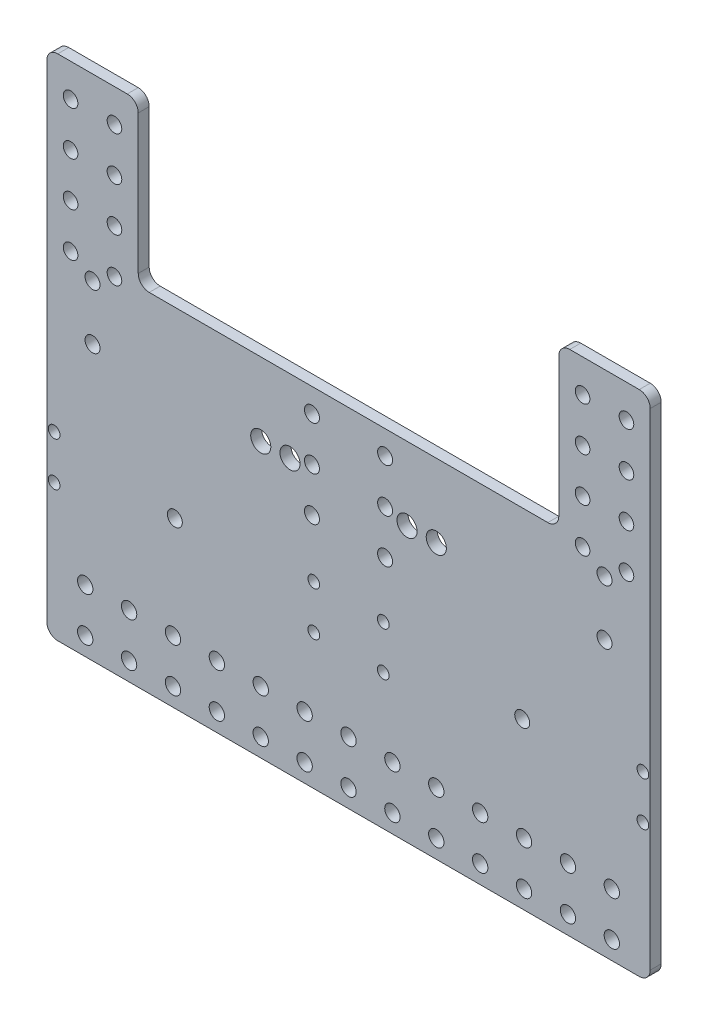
ISO-10303-21;
HEADER;
FILE_DESCRIPTION(('STEP AP214'),'2;1');
FILE_NAME('part.step','',(''),(''),'','','');
FILE_SCHEMA(('AUTOMOTIVE_DESIGN { 1 0 10303 214 1 1 1 1 }'));
ENDSEC;
DATA;
#1=APPLICATION_CONTEXT('core data for automotive mechanical design processes');
#2=APPLICATION_PROTOCOL_DEFINITION('international standard','automotive_design',2000,#1);
#3=PRODUCT_CONTEXT('',#1,'mechanical');
#4=PRODUCT('Part','Part','',(#3));
#5=PRODUCT_RELATED_PRODUCT_CATEGORY('part','',(#4));
#6=PRODUCT_DEFINITION_FORMATION('','',#4);
#7=PRODUCT_DEFINITION_CONTEXT('part definition',#1,'design');
#8=PRODUCT_DEFINITION('design','',#6,#7);
#9=PRODUCT_DEFINITION_SHAPE('','',#8);
#10=(LENGTH_UNIT() NAMED_UNIT(*) SI_UNIT(.MILLI.,.METRE.));
#11=(NAMED_UNIT(*) PLANE_ANGLE_UNIT() SI_UNIT($,.RADIAN.));
#12=(NAMED_UNIT(*) SI_UNIT($,.STERADIAN.) SOLID_ANGLE_UNIT());
#13=UNCERTAINTY_MEASURE_WITH_UNIT(LENGTH_MEASURE(1.E-05),#10,'distance_accuracy_value','');
#14=(GEOMETRIC_REPRESENTATION_CONTEXT(3) GLOBAL_UNCERTAINTY_ASSIGNED_CONTEXT((#13)) GLOBAL_UNIT_ASSIGNED_CONTEXT((#10,
#11,#12)) REPRESENTATION_CONTEXT('',''));
#15=CARTESIAN_POINT('',(0.,0.,0.));
#16=DIRECTION('',(0.,0.,1.));
#17=DIRECTION('',(1.,0.,0.));
#18=AXIS2_PLACEMENT_3D('',#15,#16,#17);
#19=CARTESIAN_POINT('',(0.,0.,3.));
#20=DIRECTION('',(0.,0.,-1.));
#21=DIRECTION('',(-1.,0.,0.));
#22=AXIS2_PLACEMENT_3D('',#19,#20,#21);
#23=PLANE('',#22);
#24=CARTESIAN_POINT('',(-80.5,-236.,3.));
#25=DIRECTION('',(0.,0.,-1.));
#26=DIRECTION('',(1.,0.,0.));
#27=AXIS2_PLACEMENT_3D('',#24,#25,#26);
#28=CIRCLE('',#27,1.59999999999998);
#29=CARTESIAN_POINT('',(-78.9,-236.,3.));
#30=VERTEX_POINT('',#29);
#31=EDGE_CURVE('E1955',#30,#30,#28,.T.);
#32=ORIENTED_EDGE('',*,*,#31,.T.);
#33=EDGE_LOOP('',(#32));
#34=FACE_BOUND('',#33,.T.);
#35=CARTESIAN_POINT('',(-9.50000000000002,-236.,3.));
#36=DIRECTION('',(0.,0.,-1.));
#37=DIRECTION('',(1.,0.,0.));
#38=AXIS2_PLACEMENT_3D('',#35,#36,#37);
#39=CIRCLE('',#38,1.59999999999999);
#40=CARTESIAN_POINT('',(-7.90000000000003,-236.,3.));
#41=VERTEX_POINT('',#40);
#42=EDGE_CURVE('E2007',#41,#41,#39,.T.);
#43=ORIENTED_EDGE('',*,*,#42,.T.);
#44=EDGE_LOOP('',(#43));
#45=FACE_BOUND('',#44,.T.);
#46=CARTESIAN_POINT('',(-80.4999999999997,-248.,3.));
#47=DIRECTION('',(0.,0.,-1.));
#48=DIRECTION('',(1.,0.,0.));
#49=AXIS2_PLACEMENT_3D('',#46,#47,#48);
#50=CIRCLE('',#49,1.60000000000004);
#51=CARTESIAN_POINT('',(-78.8999999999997,-248.,3.));
#52=VERTEX_POINT('',#51);
#53=EDGE_CURVE('E1999',#52,#52,#50,.T.);
#54=ORIENTED_EDGE('',*,*,#53,.T.);
#55=EDGE_LOOP('',(#54));
#56=FACE_BOUND('',#55,.T.);
#57=CARTESIAN_POINT('',(80.4999999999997,-248.,3.));
#58=DIRECTION('',(0.,0.,-1.));
#59=DIRECTION('',(-1.,0.,0.));
#60=AXIS2_PLACEMENT_3D('',#57,#58,#59);
#61=CIRCLE('',#60,1.6);
#62=CARTESIAN_POINT('',(78.8999999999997,-248.,3.));
#63=VERTEX_POINT('',#62);
#64=EDGE_CURVE('E1983',#63,#63,#61,.T.);
#65=ORIENTED_EDGE('',*,*,#64,.T.);
#66=EDGE_LOOP('',(#65));
#67=FACE_BOUND('',#66,.T.);
#68=CARTESIAN_POINT('',(9.49999999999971,-248.,3.));
#69=DIRECTION('',(0.,0.,-1.));
#70=DIRECTION('',(-1.,0.,0.));
#71=AXIS2_PLACEMENT_3D('',#68,#69,#70);
#72=CIRCLE('',#71,1.59999999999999);
#73=CARTESIAN_POINT('',(7.89999999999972,-248.,3.));
#74=VERTEX_POINT('',#73);
#75=EDGE_CURVE('E1977',#74,#74,#72,.T.);
#76=ORIENTED_EDGE('',*,*,#75,.T.);
#77=EDGE_LOOP('',(#76));
#78=FACE_BOUND('',#77,.T.);
#79=CARTESIAN_POINT('',(9.50000000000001,-236.,3.));
#80=DIRECTION('',(0.,0.,-1.));
#81=DIRECTION('',(-1.,0.,0.));
#82=AXIS2_PLACEMENT_3D('',#79,#80,#81);
#83=CIRCLE('',#82,1.59999999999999);
#84=CARTESIAN_POINT('',(7.90000000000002,-236.,3.));
#85=VERTEX_POINT('',#84);
#86=EDGE_CURVE('E1971',#85,#85,#83,.T.);
#87=ORIENTED_EDGE('',*,*,#86,.T.);
#88=EDGE_LOOP('',(#87));
#89=FACE_BOUND('',#88,.T.);
#90=CARTESIAN_POINT('',(-9.49999999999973,-248.,3.));
#91=DIRECTION('',(0.,0.,-1.));
#92=DIRECTION('',(1.,0.,0.));
#93=AXIS2_PLACEMENT_3D('',#90,#91,#92);
#94=CIRCLE('',#93,1.59999999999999);
#95=CARTESIAN_POINT('',(-7.89999999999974,-248.,3.));
#96=VERTEX_POINT('',#95);
#97=EDGE_CURVE('E1964',#96,#96,#94,.T.);
#98=ORIENTED_EDGE('',*,*,#97,.T.);
#99=EDGE_LOOP('',(#98));
#100=FACE_BOUND('',#99,.T.);
#101=CARTESIAN_POINT('',(80.5,-236.,3.));
#102=DIRECTION('',(0.,0.,-1.));
#103=DIRECTION('',(-1.,0.,0.));
#104=AXIS2_PLACEMENT_3D('',#101,#102,#103);
#105=CIRCLE('',#104,1.6);
#106=CARTESIAN_POINT('',(78.9,-236.,3.));
#107=VERTEX_POINT('',#106);
#108=EDGE_CURVE('E252',#107,#107,#105,.T.);
#109=ORIENTED_EDGE('',*,*,#108,.T.);
#110=EDGE_LOOP('',(#109));
#111=FACE_BOUND('',#110,.T.);
#112=DIRECTION('',(0.,-1.,0.));
#113=VECTOR('',#112,1.);
#114=CARTESIAN_POINT('',(-82.5,-215.,3.));
#115=LINE('',#114,#113);
#116=CARTESIAN_POINT('',(-82.5,-149.,3.));
#117=VERTEX_POINT('',#116);
#118=CARTESIAN_POINT('',(-82.5,-282.,3.));
#119=VERTEX_POINT('',#118);
#120=EDGE_CURVE('E162',#117,#119,#115,.T.);
#121=ORIENTED_EDGE('',*,*,#120,.T.);
#122=CARTESIAN_POINT('',(-79.5,-282.,3.));
#123=DIRECTION('',(0.,0.,-1.));
#124=DIRECTION('',(-1.,0.,0.));
#125=AXIS2_PLACEMENT_3D('',#122,#123,#124);
#126=CIRCLE('',#125,3.);
#127=CARTESIAN_POINT('',(-79.5,-285.,3.));
#128=VERTEX_POINT('',#127);
#129=EDGE_CURVE('E637',#119,#128,#126,.F.);
#130=ORIENTED_EDGE('',*,*,#129,.T.);
#131=DIRECTION('',(1.,0.,0.));
#132=VECTOR('',#131,1.);
#133=CARTESIAN_POINT('',(-82.5,-285.,3.));
#134=LINE('',#133,#132);
#135=CARTESIAN_POINT('',(79.5,-285.,3.));
#136=VERTEX_POINT('',#135);
#137=EDGE_CURVE('E430',#128,#136,#134,.T.);
#138=ORIENTED_EDGE('',*,*,#137,.T.);
#139=CARTESIAN_POINT('',(79.5,-282.,3.));
#140=DIRECTION('',(0.,0.,-1.));
#141=DIRECTION('',(-1.,0.,0.));
#142=AXIS2_PLACEMENT_3D('',#139,#140,#141);
#143=CIRCLE('',#142,3.);
#144=CARTESIAN_POINT('',(82.5,-282.,3.));
#145=VERTEX_POINT('',#144);
#146=EDGE_CURVE('E635',#136,#145,#143,.F.);
#147=ORIENTED_EDGE('',*,*,#146,.T.);
#148=DIRECTION('',(0.,1.,0.));
#149=VECTOR('',#148,1.);
#150=CARTESIAN_POINT('',(82.5,-215.,3.));
#151=LINE('',#150,#149);
#152=CARTESIAN_POINT('',(82.5,-149.,3.));
#153=VERTEX_POINT('',#152);
#154=EDGE_CURVE('E174',#145,#153,#151,.T.);
#155=ORIENTED_EDGE('',*,*,#154,.T.);
#156=CARTESIAN_POINT('',(79.5,-149.,3.));
#157=DIRECTION('',(0.,0.,-1.));
#158=DIRECTION('',(-1.,0.,0.));
#159=AXIS2_PLACEMENT_3D('',#156,#157,#158);
#160=CIRCLE('',#159,3.);
#161=CARTESIAN_POINT('',(79.5,-146.,3.));
#162=VERTEX_POINT('',#161);
#163=EDGE_CURVE('E627',#153,#162,#160,.F.);
#164=ORIENTED_EDGE('',*,*,#163,.T.);
#165=DIRECTION('',(-1.,0.,0.));
#166=VECTOR('',#165,1.);
#167=CARTESIAN_POINT('',(82.5,-146.,3.));
#168=LINE('',#167,#166);
#169=CARTESIAN_POINT('',(60.5,-146.,3.));
#170=VERTEX_POINT('',#169);
#171=EDGE_CURVE('E514',#162,#170,#168,.T.);
#172=ORIENTED_EDGE('',*,*,#171,.T.);
#173=CARTESIAN_POINT('',(60.5,-149.,3.));
#174=DIRECTION('',(0.,0.,-1.));
#175=DIRECTION('',(-1.,0.,0.));
#176=AXIS2_PLACEMENT_3D('',#173,#174,#175);
#177=CIRCLE('',#176,3.);
#178=CARTESIAN_POINT('',(57.5,-149.,3.));
#179=VERTEX_POINT('',#178);
#180=EDGE_CURVE('E629',#170,#179,#177,.F.);
#181=ORIENTED_EDGE('',*,*,#180,.T.);
#182=DIRECTION('',(0.,-1.,0.));
#183=VECTOR('',#182,1.);
#184=CARTESIAN_POINT('',(57.5,-171.,3.));
#185=LINE('',#184,#183);
#186=CARTESIAN_POINT('',(57.5,-187.,3.));
#187=VERTEX_POINT('',#186);
#188=EDGE_CURVE('E244',#179,#187,#185,.T.);
#189=ORIENTED_EDGE('',*,*,#188,.T.);
#190=CARTESIAN_POINT('',(54.5,-187.,3.));
#191=DIRECTION('',(0.,0.,-1.));
#192=DIRECTION('',(-1.,0.,0.));
#193=AXIS2_PLACEMENT_3D('',#190,#191,#192);
#194=CIRCLE('',#193,3.);
#195=CARTESIAN_POINT('',(54.5,-190.,3.));
#196=VERTEX_POINT('',#195);
#197=EDGE_CURVE('E11',#187,#196,#194,.T.);
#198=ORIENTED_EDGE('',*,*,#197,.T.);
#199=DIRECTION('',(-1.,0.,0.));
#200=VECTOR('',#199,1.);
#201=CARTESIAN_POINT('',(0.,-190.,3.));
#202=LINE('',#201,#200);
#203=CARTESIAN_POINT('',(-54.5,-190.,3.));
#204=VERTEX_POINT('',#203);
#205=EDGE_CURVE('E242',#196,#204,#202,.T.);
#206=ORIENTED_EDGE('',*,*,#205,.T.);
#207=CARTESIAN_POINT('',(-54.5,-187.,3.));
#208=DIRECTION('',(0.,0.,-1.));
#209=DIRECTION('',(-1.,0.,0.));
#210=AXIS2_PLACEMENT_3D('',#207,#208,#209);
#211=CIRCLE('',#210,3.);
#212=CARTESIAN_POINT('',(-57.5,-187.,3.));
#213=VERTEX_POINT('',#212);
#214=EDGE_CURVE('E217',#204,#213,#211,.T.);
#215=ORIENTED_EDGE('',*,*,#214,.T.);
#216=DIRECTION('',(0.,1.,0.));
#217=VECTOR('',#216,1.);
#218=CARTESIAN_POINT('',(-57.5,-171.,3.));
#219=LINE('',#218,#217);
#220=CARTESIAN_POINT('',(-57.5,-149.,3.));
#221=VERTEX_POINT('',#220);
#222=EDGE_CURVE('E233',#213,#221,#219,.T.);
#223=ORIENTED_EDGE('',*,*,#222,.T.);
#224=CARTESIAN_POINT('',(-60.5,-149.,3.));
#225=DIRECTION('',(0.,0.,-1.));
#226=DIRECTION('',(-1.,0.,0.));
#227=AXIS2_PLACEMENT_3D('',#224,#225,#226);
#228=CIRCLE('',#227,3.);
#229=CARTESIAN_POINT('',(-60.5,-146.,3.));
#230=VERTEX_POINT('',#229);
#231=EDGE_CURVE('E631',#221,#230,#228,.F.);
#232=ORIENTED_EDGE('',*,*,#231,.T.);
#233=DIRECTION('',(-1.,0.,0.));
#234=VECTOR('',#233,1.);
#235=CARTESIAN_POINT('',(-82.5,-146.,3.));
#236=LINE('',#235,#234);
#237=CARTESIAN_POINT('',(-79.5,-146.,3.));
#238=VERTEX_POINT('',#237);
#239=EDGE_CURVE('E519',#230,#238,#236,.T.);
#240=ORIENTED_EDGE('',*,*,#239,.T.);
#241=CARTESIAN_POINT('',(-79.5,-149.,3.));
#242=DIRECTION('',(0.,0.,-1.));
#243=DIRECTION('',(-1.,0.,0.));
#244=AXIS2_PLACEMENT_3D('',#241,#242,#243);
#245=CIRCLE('',#244,3.);
#246=EDGE_CURVE('E633',#238,#117,#245,.F.);
#247=ORIENTED_EDGE('',*,*,#246,.T.);
#248=EDGE_LOOP('',(#121,#130,#138,#147,#155,#164,#172,#181,#189,#198,#206,#215,#223,#232,#240,#247));
#249=FACE_BOUND('',#248,.T.);
#250=CARTESIAN_POINT('',(-70.,-210.,3.));
#251=DIRECTION('',(0.,0.,-1.));
#252=DIRECTION('',(-1.,0.,0.));
#253=AXIS2_PLACEMENT_3D('',#250,#251,#252);
#254=CIRCLE('',#253,2.04999999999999);
#255=CARTESIAN_POINT('',(-72.05,-210.,3.));
#256=VERTEX_POINT('',#255);
#257=EDGE_CURVE('E267',#256,#256,#254,.T.);
#258=ORIENTED_EDGE('',*,*,#257,.T.);
#259=EDGE_LOOP('',(#258));
#260=FACE_BOUND('',#259,.T.);
#261=CARTESIAN_POINT('',(70.,-210.,3.));
#262=DIRECTION('',(0.,0.,-1.));
#263=DIRECTION('',(-1.,0.,0.));
#264=AXIS2_PLACEMENT_3D('',#261,#262,#263);
#265=CIRCLE('',#264,2.04999999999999);
#266=CARTESIAN_POINT('',(67.95,-210.,3.));
#267=VERTEX_POINT('',#266);
#268=EDGE_CURVE('E264',#267,#267,#265,.T.);
#269=ORIENTED_EDGE('',*,*,#268,.T.);
#270=EDGE_LOOP('',(#269));
#271=FACE_BOUND('',#270,.T.);
#272=CARTESIAN_POINT('',(69.9999999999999,-195.,3.));
#273=DIRECTION('',(0.,0.,-1.));
#274=DIRECTION('',(-1.,0.,0.));
#275=AXIS2_PLACEMENT_3D('',#272,#273,#274);
#276=CIRCLE('',#275,2.04999999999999);
#277=CARTESIAN_POINT('',(67.9499999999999,-195.,3.));
#278=VERTEX_POINT('',#277);
#279=EDGE_CURVE('E259',#278,#278,#276,.T.);
#280=ORIENTED_EDGE('',*,*,#279,.T.);
#281=EDGE_LOOP('',(#280));
#282=FACE_BOUND('',#281,.T.);
#283=CARTESIAN_POINT('',(-70.,-195.,3.));
#284=DIRECTION('',(0.,0.,-1.));
#285=DIRECTION('',(-1.,0.,0.));
#286=AXIS2_PLACEMENT_3D('',#283,#284,#285);
#287=CIRCLE('',#286,2.04999999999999);
#288=CARTESIAN_POINT('',(-72.05,-195.,3.));
#289=VERTEX_POINT('',#288);
#290=EDGE_CURVE('E273',#289,#289,#287,.T.);
#291=ORIENTED_EDGE('',*,*,#290,.T.);
#292=EDGE_LOOP('',(#291));
#293=FACE_BOUND('',#292,.T.);
#294=CARTESIAN_POINT('',(-15.9999999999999,-210.,3.));
#295=DIRECTION('',(0.,0.,1.));
#296=DIRECTION('',(1.,0.,0.));
#297=AXIS2_PLACEMENT_3D('',#294,#295,#296);
#298=CIRCLE('',#297,2.75);
#299=CARTESIAN_POINT('',(-13.2499999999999,-210.,3.));
#300=VERTEX_POINT('',#299);
#301=EDGE_CURVE('E439',#300,#300,#298,.T.);
#302=ORIENTED_EDGE('',*,*,#301,.F.);
#303=EDGE_LOOP('',(#302));
#304=FACE_BOUND('',#303,.T.);
#305=CARTESIAN_POINT('',(16.0000000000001,-210.,3.));
#306=DIRECTION('',(0.,0.,1.));
#307=DIRECTION('',(1.,0.,0.));
#308=AXIS2_PLACEMENT_3D('',#305,#306,#307);
#309=CIRCLE('',#308,2.75);
#310=CARTESIAN_POINT('',(18.7500000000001,-210.,3.));
#311=VERTEX_POINT('',#310);
#312=EDGE_CURVE('E447',#311,#311,#309,.T.);
#313=ORIENTED_EDGE('',*,*,#312,.F.);
#314=EDGE_LOOP('',(#313));
#315=FACE_BOUND('',#314,.T.);
#316=CARTESIAN_POINT('',(24.0000000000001,-210.,3.));
#317=DIRECTION('',(0.,0.,1.));
#318=DIRECTION('',(1.,0.,0.));
#319=AXIS2_PLACEMENT_3D('',#316,#317,#318);
#320=CIRCLE('',#319,2.75);
#321=CARTESIAN_POINT('',(26.7500000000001,-210.,3.));
#322=VERTEX_POINT('',#321);
#323=EDGE_CURVE('E436',#322,#322,#320,.T.);
#324=ORIENTED_EDGE('',*,*,#323,.F.);
#325=EDGE_LOOP('',(#324));
#326=FACE_BOUND('',#325,.T.);
#327=CARTESIAN_POINT('',(-23.9999999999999,-210.,3.));
#328=DIRECTION('',(0.,0.,1.));
#329=DIRECTION('',(1.,0.,0.));
#330=AXIS2_PLACEMENT_3D('',#327,#328,#329);
#331=CIRCLE('',#330,2.74999999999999);
#332=CARTESIAN_POINT('',(-21.2499999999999,-210.,3.));
#333=VERTEX_POINT('',#332);
#334=EDGE_CURVE('E446',#333,#333,#331,.T.);
#335=ORIENTED_EDGE('',*,*,#334,.F.);
#336=EDGE_LOOP('',(#335));
#337=FACE_BOUND('',#336,.T.);
#338=CARTESIAN_POINT('',(-64.,-155.,3.));
#339=DIRECTION('',(0.,0.,1.));
#340=DIRECTION('',(1.,0.,0.));
#341=AXIS2_PLACEMENT_3D('',#338,#339,#340);
#342=CIRCLE('',#341,2.);
#343=CARTESIAN_POINT('',(-62.,-155.,3.));
#344=VERTEX_POINT('',#343);
#345=EDGE_CURVE('E463',#344,#344,#342,.T.);
#346=ORIENTED_EDGE('',*,*,#345,.F.);
#347=EDGE_LOOP('',(#346));
#348=FACE_BOUND('',#347,.T.);
#349=CARTESIAN_POINT('',(64.,-155.,3.));
#350=DIRECTION('',(0.,0.,1.));
#351=DIRECTION('',(-1.,0.,0.));
#352=AXIS2_PLACEMENT_3D('',#349,#350,#351);
#353=CIRCLE('',#352,2.);
#354=CARTESIAN_POINT('',(62.,-155.,3.));
#355=VERTEX_POINT('',#354);
#356=EDGE_CURVE('E467',#355,#355,#353,.T.);
#357=ORIENTED_EDGE('',*,*,#356,.F.);
#358=EDGE_LOOP('',(#357));
#359=FACE_BOUND('',#358,.T.);
#360=CARTESIAN_POINT('',(76.,-155.,3.));
#361=DIRECTION('',(0.,0.,1.));
#362=DIRECTION('',(-1.,0.,0.));
#363=AXIS2_PLACEMENT_3D('',#360,#361,#362);
#364=CIRCLE('',#363,2.);
#365=CARTESIAN_POINT('',(74.,-155.,3.));
#366=VERTEX_POINT('',#365);
#367=EDGE_CURVE('E470',#366,#366,#364,.T.);
#368=ORIENTED_EDGE('',*,*,#367,.F.);
#369=EDGE_LOOP('',(#368));
#370=FACE_BOUND('',#369,.T.);
#371=CARTESIAN_POINT('',(-75.9999999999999,-167.,3.));
#372=DIRECTION('',(0.,0.,1.));
#373=DIRECTION('',(1.,0.,0.));
#374=AXIS2_PLACEMENT_3D('',#371,#372,#373);
#375=CIRCLE('',#374,2.);
#376=CARTESIAN_POINT('',(-73.9999999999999,-167.,3.));
#377=VERTEX_POINT('',#376);
#378=EDGE_CURVE('E473',#377,#377,#375,.T.);
#379=ORIENTED_EDGE('',*,*,#378,.F.);
#380=EDGE_LOOP('',(#379));
#381=FACE_BOUND('',#380,.T.);
#382=CARTESIAN_POINT('',(-63.9999999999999,-167.,3.));
#383=DIRECTION('',(0.,0.,1.));
#384=DIRECTION('',(1.,0.,0.));
#385=AXIS2_PLACEMENT_3D('',#382,#383,#384);
#386=CIRCLE('',#385,2.);
#387=CARTESIAN_POINT('',(-61.9999999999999,-167.,3.));
#388=VERTEX_POINT('',#387);
#389=EDGE_CURVE('E476',#388,#388,#386,.T.);
#390=ORIENTED_EDGE('',*,*,#389,.F.);
#391=EDGE_LOOP('',(#390));
#392=FACE_BOUND('',#391,.T.);
#393=CARTESIAN_POINT('',(64.0000000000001,-167.,3.));
#394=DIRECTION('',(0.,0.,1.));
#395=DIRECTION('',(-1.,0.,0.));
#396=AXIS2_PLACEMENT_3D('',#393,#394,#395);
#397=CIRCLE('',#396,2.);
#398=CARTESIAN_POINT('',(62.0000000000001,-167.,3.));
#399=VERTEX_POINT('',#398);
#400=EDGE_CURVE('E479',#399,#399,#397,.T.);
#401=ORIENTED_EDGE('',*,*,#400,.F.);
#402=EDGE_LOOP('',(#401));
#403=FACE_BOUND('',#402,.T.);
#404=CARTESIAN_POINT('',(76.0000000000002,-167.,3.));
#405=DIRECTION('',(0.,0.,1.));
#406=DIRECTION('',(-1.,0.,0.));
#407=AXIS2_PLACEMENT_3D('',#404,#405,#406);
#408=CIRCLE('',#407,2.);
#409=CARTESIAN_POINT('',(74.0000000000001,-167.,3.));
#410=VERTEX_POINT('',#409);
#411=EDGE_CURVE('E482',#410,#410,#408,.T.);
#412=ORIENTED_EDGE('',*,*,#411,.F.);
#413=EDGE_LOOP('',(#412));
#414=FACE_BOUND('',#413,.T.);
#415=CARTESIAN_POINT('',(-75.9999999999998,-179.,3.));
#416=DIRECTION('',(0.,0.,1.));
#417=DIRECTION('',(1.,0.,0.));
#418=AXIS2_PLACEMENT_3D('',#415,#416,#417);
#419=CIRCLE('',#418,2.);
#420=CARTESIAN_POINT('',(-73.9999999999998,-179.,3.));
#421=VERTEX_POINT('',#420);
#422=EDGE_CURVE('E485',#421,#421,#419,.T.);
#423=ORIENTED_EDGE('',*,*,#422,.F.);
#424=EDGE_LOOP('',(#423));
#425=FACE_BOUND('',#424,.T.);
#426=CARTESIAN_POINT('',(-63.9999999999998,-179.,3.));
#427=DIRECTION('',(0.,0.,1.));
#428=DIRECTION('',(1.,0.,0.));
#429=AXIS2_PLACEMENT_3D('',#426,#427,#428);
#430=CIRCLE('',#429,2.);
#431=CARTESIAN_POINT('',(-61.9999999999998,-179.,3.));
#432=VERTEX_POINT('',#431);
#433=EDGE_CURVE('E488',#432,#432,#430,.T.);
#434=ORIENTED_EDGE('',*,*,#433,.F.);
#435=EDGE_LOOP('',(#434));
#436=FACE_BOUND('',#435,.T.);
#437=CARTESIAN_POINT('',(64.0000000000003,-179.,3.));
#438=DIRECTION('',(0.,0.,1.));
#439=DIRECTION('',(-1.,0.,0.));
#440=AXIS2_PLACEMENT_3D('',#437,#438,#439);
#441=CIRCLE('',#440,2.);
#442=CARTESIAN_POINT('',(62.0000000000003,-179.,3.));
#443=VERTEX_POINT('',#442);
#444=EDGE_CURVE('E491',#443,#443,#441,.T.);
#445=ORIENTED_EDGE('',*,*,#444,.F.);
#446=EDGE_LOOP('',(#445));
#447=FACE_BOUND('',#446,.T.);
#448=CARTESIAN_POINT('',(76.0000000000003,-179.,3.));
#449=DIRECTION('',(0.,0.,1.));
#450=DIRECTION('',(-1.,0.,0.));
#451=AXIS2_PLACEMENT_3D('',#448,#449,#450);
#452=CIRCLE('',#451,2.);
#453=CARTESIAN_POINT('',(74.0000000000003,-179.,3.));
#454=VERTEX_POINT('',#453);
#455=EDGE_CURVE('E494',#454,#454,#452,.T.);
#456=ORIENTED_EDGE('',*,*,#455,.F.);
#457=EDGE_LOOP('',(#456));
#458=FACE_BOUND('',#457,.T.);
#459=CARTESIAN_POINT('',(-75.9999999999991,-191.,3.));
#460=DIRECTION('',(0.,0.,1.));
#461=DIRECTION('',(1.,0.,0.));
#462=AXIS2_PLACEMENT_3D('',#459,#460,#461);
#463=CIRCLE('',#462,2.);
#464=CARTESIAN_POINT('',(-73.9999999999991,-191.,3.));
#465=VERTEX_POINT('',#464);
#466=EDGE_CURVE('E497',#465,#465,#463,.T.);
#467=ORIENTED_EDGE('',*,*,#466,.F.);
#468=EDGE_LOOP('',(#467));
#469=FACE_BOUND('',#468,.T.);
#470=CARTESIAN_POINT('',(-63.9999999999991,-191.,3.));
#471=DIRECTION('',(0.,0.,1.));
#472=DIRECTION('',(1.,0.,0.));
#473=AXIS2_PLACEMENT_3D('',#470,#471,#472);
#474=CIRCLE('',#473,2.);
#475=CARTESIAN_POINT('',(-61.9999999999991,-191.,3.));
#476=VERTEX_POINT('',#475);
#477=EDGE_CURVE('E500',#476,#476,#474,.T.);
#478=ORIENTED_EDGE('',*,*,#477,.F.);
#479=EDGE_LOOP('',(#478));
#480=FACE_BOUND('',#479,.T.);
#481=CARTESIAN_POINT('',(64.0000000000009,-191.,3.));
#482=DIRECTION('',(0.,0.,1.));
#483=DIRECTION('',(-1.,0.,0.));
#484=AXIS2_PLACEMENT_3D('',#481,#482,#483);
#485=CIRCLE('',#484,2.);
#486=CARTESIAN_POINT('',(62.0000000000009,-191.,3.));
#487=VERTEX_POINT('',#486);
#488=EDGE_CURVE('E503',#487,#487,#485,.T.);
#489=ORIENTED_EDGE('',*,*,#488,.F.);
#490=EDGE_LOOP('',(#489));
#491=FACE_BOUND('',#490,.T.);
#492=CARTESIAN_POINT('',(76.0000000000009,-191.,3.));
#493=DIRECTION('',(0.,0.,1.));
#494=DIRECTION('',(-1.,0.,0.));
#495=AXIS2_PLACEMENT_3D('',#492,#493,#494);
#496=CIRCLE('',#495,2.);
#497=CARTESIAN_POINT('',(74.0000000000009,-191.,3.));
#498=VERTEX_POINT('',#497);
#499=EDGE_CURVE('E462',#498,#498,#496,.T.);
#500=ORIENTED_EDGE('',*,*,#499,.F.);
#501=EDGE_LOOP('',(#500));
#502=FACE_BOUND('',#501,.T.);
#503=CARTESIAN_POINT('',(-76.,-155.,3.));
#504=DIRECTION('',(0.,0.,1.));
#505=DIRECTION('',(1.,0.,0.));
#506=AXIS2_PLACEMENT_3D('',#503,#504,#505);
#507=CIRCLE('',#506,2.);
#508=CARTESIAN_POINT('',(-74.,-155.,3.));
#509=VERTEX_POINT('',#508);
#510=EDGE_CURVE('E508',#509,#509,#507,.T.);
#511=ORIENTED_EDGE('',*,*,#510,.F.);
#512=EDGE_LOOP('',(#511));
#513=FACE_BOUND('',#512,.T.);
#514=CARTESIAN_POINT('',(10.,-220.5,3.));
#515=DIRECTION('',(0.,0.,1.));
#516=DIRECTION('',(-1.,0.,0.));
#517=AXIS2_PLACEMENT_3D('',#514,#515,#516);
#518=CIRCLE('',#517,2.05);
#519=CARTESIAN_POINT('',(7.95000000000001,-220.5,3.));
#520=VERTEX_POINT('',#519);
#521=EDGE_CURVE('E527',#520,#520,#518,.T.);
#522=ORIENTED_EDGE('',*,*,#521,.F.);
#523=EDGE_LOOP('',(#522));
#524=FACE_BOUND('',#523,.T.);
#525=CARTESIAN_POINT('',(-9.99999999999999,-220.5,3.));
#526=DIRECTION('',(0.,0.,1.));
#527=DIRECTION('',(1.,0.,0.));
#528=AXIS2_PLACEMENT_3D('',#525,#526,#527);
#529=CIRCLE('',#528,2.05);
#530=CARTESIAN_POINT('',(-7.95,-220.5,3.));
#531=VERTEX_POINT('',#530);
#532=EDGE_CURVE('E532',#531,#531,#529,.T.);
#533=ORIENTED_EDGE('',*,*,#532,.F.);
#534=EDGE_LOOP('',(#533));
#535=FACE_BOUND('',#534,.T.);
#536=CARTESIAN_POINT('',(-10.,-196.5,3.));
#537=DIRECTION('',(0.,0.,-1.));
#538=DIRECTION('',(-1.,0.,0.));
#539=AXIS2_PLACEMENT_3D('',#536,#537,#538);
#540=CIRCLE('',#539,2.05);
#541=CARTESIAN_POINT('',(-12.05,-196.5,3.));
#542=VERTEX_POINT('',#541);
#543=EDGE_CURVE('E551',#542,#542,#540,.T.);
#544=ORIENTED_EDGE('',*,*,#543,.T.);
#545=EDGE_LOOP('',(#544));
#546=FACE_BOUND('',#545,.T.);
#547=CARTESIAN_POINT('',(-10.0000000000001,-208.5,3.));
#548=DIRECTION('',(0.,0.,-1.));
#549=DIRECTION('',(-1.,0.,0.));
#550=AXIS2_PLACEMENT_3D('',#547,#548,#549);
#551=CIRCLE('',#550,2.05);
#552=CARTESIAN_POINT('',(-12.0500000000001,-208.5,3.));
#553=VERTEX_POINT('',#552);
#554=EDGE_CURVE('E548',#553,#553,#551,.T.);
#555=ORIENTED_EDGE('',*,*,#554,.T.);
#556=EDGE_LOOP('',(#555));
#557=FACE_BOUND('',#556,.T.);
#558=CARTESIAN_POINT('',(9.99999999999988,-208.5,3.));
#559=DIRECTION('',(0.,0.,-1.));
#560=DIRECTION('',(-1.,0.,0.));
#561=AXIS2_PLACEMENT_3D('',#558,#559,#560);
#562=CIRCLE('',#561,2.05);
#563=CARTESIAN_POINT('',(7.94999999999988,-208.5,3.));
#564=VERTEX_POINT('',#563);
#565=EDGE_CURVE('E539',#564,#564,#562,.T.);
#566=ORIENTED_EDGE('',*,*,#565,.T.);
#567=EDGE_LOOP('',(#566));
#568=FACE_BOUND('',#567,.T.);
#569=CARTESIAN_POINT('',(10.,-196.5,3.));
#570=DIRECTION('',(0.,0.,-1.));
#571=DIRECTION('',(-1.,0.,0.));
#572=AXIS2_PLACEMENT_3D('',#569,#570,#571);
#573=CIRCLE('',#572,2.05);
#574=CARTESIAN_POINT('',(7.95,-196.5,3.));
#575=VERTEX_POINT('',#574);
#576=EDGE_CURVE('E557',#575,#575,#573,.T.);
#577=ORIENTED_EDGE('',*,*,#576,.T.);
#578=EDGE_LOOP('',(#577));
#579=FACE_BOUND('',#578,.T.);
#580=CARTESIAN_POINT('',(47.5,-240.,3.));
#581=DIRECTION('',(0.,0.,1.));
#582=DIRECTION('',(1.,0.,0.));
#583=AXIS2_PLACEMENT_3D('',#580,#581,#582);
#584=CIRCLE('',#583,2.04999999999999);
#585=CARTESIAN_POINT('',(49.55,-240.,3.));
#586=VERTEX_POINT('',#585);
#587=EDGE_CURVE('E563',#586,#586,#584,.T.);
#588=ORIENTED_EDGE('',*,*,#587,.F.);
#589=EDGE_LOOP('',(#588));
#590=FACE_BOUND('',#589,.T.);
#591=CARTESIAN_POINT('',(-47.5,-240.,3.));
#592=DIRECTION('',(0.,0.,1.));
#593=DIRECTION('',(1.,0.,0.));
#594=AXIS2_PLACEMENT_3D('',#591,#592,#593);
#595=CIRCLE('',#594,2.05);
#596=CARTESIAN_POINT('',(-45.45,-240.,3.));
#597=VERTEX_POINT('',#596);
#598=EDGE_CURVE('E560',#597,#597,#595,.T.);
#599=ORIENTED_EDGE('',*,*,#598,.F.);
#600=EDGE_LOOP('',(#599));
#601=FACE_BOUND('',#600,.T.);
#602=CARTESIAN_POINT('',(-72.0000000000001,-268.,3.));
#603=DIRECTION('',(0.,0.,1.));
#604=DIRECTION('',(1.,0.,0.));
#605=AXIS2_PLACEMENT_3D('',#602,#603,#604);
#606=CIRCLE('',#605,2.1);
#607=CARTESIAN_POINT('',(-69.9,-268.,3.));
#608=VERTEX_POINT('',#607);
#609=EDGE_CURVE('E276',#608,#608,#606,.T.);
#610=ORIENTED_EDGE('',*,*,#609,.F.);
#611=EDGE_LOOP('',(#610));
#612=FACE_BOUND('',#611,.T.);
#613=CARTESIAN_POINT('',(72.,-268.,3.));
#614=DIRECTION('',(0.,0.,1.));
#615=DIRECTION('',(1.,0.,0.));
#616=AXIS2_PLACEMENT_3D('',#613,#614,#615);
#617=CIRCLE('',#616,2.1);
#618=CARTESIAN_POINT('',(74.1,-268.,3.));
#619=VERTEX_POINT('',#618);
#620=EDGE_CURVE('E280',#619,#619,#617,.T.);
#621=ORIENTED_EDGE('',*,*,#620,.F.);
#622=EDGE_LOOP('',(#621));
#623=FACE_BOUND('',#622,.T.);
#624=CARTESIAN_POINT('',(59.9999999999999,-268.,3.));
#625=DIRECTION('',(0.,0.,1.));
#626=DIRECTION('',(1.,0.,0.));
#627=AXIS2_PLACEMENT_3D('',#624,#625,#626);
#628=CIRCLE('',#627,2.1);
#629=CARTESIAN_POINT('',(62.0999999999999,-268.,3.));
#630=VERTEX_POINT('',#629);
#631=EDGE_CURVE('E286',#630,#630,#628,.T.);
#632=ORIENTED_EDGE('',*,*,#631,.F.);
#633=EDGE_LOOP('',(#632));
#634=FACE_BOUND('',#633,.T.);
#635=CARTESIAN_POINT('',(47.9999999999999,-268.,3.));
#636=DIRECTION('',(0.,0.,1.));
#637=DIRECTION('',(1.,0.,0.));
#638=AXIS2_PLACEMENT_3D('',#635,#636,#637);
#639=CIRCLE('',#638,2.1);
#640=CARTESIAN_POINT('',(50.1,-268.,3.));
#641=VERTEX_POINT('',#640);
#642=EDGE_CURVE('E292',#641,#641,#639,.T.);
#643=ORIENTED_EDGE('',*,*,#642,.F.);
#644=EDGE_LOOP('',(#643));
#645=FACE_BOUND('',#644,.T.);
#646=CARTESIAN_POINT('',(36.,-268.,3.));
#647=DIRECTION('',(0.,0.,1.));
#648=DIRECTION('',(1.,0.,0.));
#649=AXIS2_PLACEMENT_3D('',#646,#647,#648);
#650=CIRCLE('',#649,2.1);
#651=CARTESIAN_POINT('',(38.1,-268.,3.));
#652=VERTEX_POINT('',#651);
#653=EDGE_CURVE('E298',#652,#652,#650,.T.);
#654=ORIENTED_EDGE('',*,*,#653,.F.);
#655=EDGE_LOOP('',(#654));
#656=FACE_BOUND('',#655,.T.);
#657=CARTESIAN_POINT('',(24.,-268.,3.));
#658=DIRECTION('',(0.,0.,1.));
#659=DIRECTION('',(1.,0.,0.));
#660=AXIS2_PLACEMENT_3D('',#657,#658,#659);
#661=CIRCLE('',#660,2.1);
#662=CARTESIAN_POINT('',(26.1,-268.,3.));
#663=VERTEX_POINT('',#662);
#664=EDGE_CURVE('E304',#663,#663,#661,.T.);
#665=ORIENTED_EDGE('',*,*,#664,.F.);
#666=EDGE_LOOP('',(#665));
#667=FACE_BOUND('',#666,.T.);
#668=CARTESIAN_POINT('',(12.,-268.,3.));
#669=DIRECTION('',(0.,0.,1.));
#670=DIRECTION('',(1.,0.,0.));
#671=AXIS2_PLACEMENT_3D('',#668,#669,#670);
#672=CIRCLE('',#671,2.1);
#673=CARTESIAN_POINT('',(14.1,-268.,3.));
#674=VERTEX_POINT('',#673);
#675=EDGE_CURVE('E310',#674,#674,#672,.T.);
#676=ORIENTED_EDGE('',*,*,#675,.F.);
#677=EDGE_LOOP('',(#676));
#678=FACE_BOUND('',#677,.T.);
#679=CARTESIAN_POINT('',(0.,-268.,3.));
#680=DIRECTION('',(0.,0.,1.));
#681=DIRECTION('',(1.,0.,0.));
#682=AXIS2_PLACEMENT_3D('',#679,#680,#681);
#683=CIRCLE('',#682,2.1);
#684=CARTESIAN_POINT('',(2.09999999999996,-268.,3.));
#685=VERTEX_POINT('',#684);
#686=EDGE_CURVE('E316',#685,#685,#683,.T.);
#687=ORIENTED_EDGE('',*,*,#686,.F.);
#688=EDGE_LOOP('',(#687));
#689=FACE_BOUND('',#688,.T.);
#690=CARTESIAN_POINT('',(-12.0000000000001,-268.,3.));
#691=DIRECTION('',(0.,0.,1.));
#692=DIRECTION('',(1.,0.,0.));
#693=AXIS2_PLACEMENT_3D('',#690,#691,#692);
#694=CIRCLE('',#693,2.1);
#695=CARTESIAN_POINT('',(-9.90000000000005,-268.,3.));
#696=VERTEX_POINT('',#695);
#697=EDGE_CURVE('E322',#696,#696,#694,.T.);
#698=ORIENTED_EDGE('',*,*,#697,.F.);
#699=EDGE_LOOP('',(#698));
#700=FACE_BOUND('',#699,.T.);
#701=CARTESIAN_POINT('',(-24.,-268.,3.));
#702=DIRECTION('',(0.,0.,1.));
#703=DIRECTION('',(1.,0.,0.));
#704=AXIS2_PLACEMENT_3D('',#701,#702,#703);
#705=CIRCLE('',#704,2.1);
#706=CARTESIAN_POINT('',(-21.9,-268.,3.));
#707=VERTEX_POINT('',#706);
#708=EDGE_CURVE('E328',#707,#707,#705,.T.);
#709=ORIENTED_EDGE('',*,*,#708,.F.);
#710=EDGE_LOOP('',(#709));
#711=FACE_BOUND('',#710,.T.);
#712=CARTESIAN_POINT('',(-36.,-268.,3.));
#713=DIRECTION('',(0.,0.,1.));
#714=DIRECTION('',(1.,0.,0.));
#715=AXIS2_PLACEMENT_3D('',#712,#713,#714);
#716=CIRCLE('',#715,2.1);
#717=CARTESIAN_POINT('',(-33.9,-268.,3.));
#718=VERTEX_POINT('',#717);
#719=EDGE_CURVE('E334',#718,#718,#716,.T.);
#720=ORIENTED_EDGE('',*,*,#719,.F.);
#721=EDGE_LOOP('',(#720));
#722=FACE_BOUND('',#721,.T.);
#723=CARTESIAN_POINT('',(-48.,-268.,3.));
#724=DIRECTION('',(0.,0.,1.));
#725=DIRECTION('',(1.,0.,0.));
#726=AXIS2_PLACEMENT_3D('',#723,#724,#725);
#727=CIRCLE('',#726,2.1);
#728=CARTESIAN_POINT('',(-45.9,-268.,3.));
#729=VERTEX_POINT('',#728);
#730=EDGE_CURVE('E340',#729,#729,#727,.T.);
#731=ORIENTED_EDGE('',*,*,#730,.F.);
#732=EDGE_LOOP('',(#731));
#733=FACE_BOUND('',#732,.T.);
#734=CARTESIAN_POINT('',(-60.0000000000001,-268.,3.));
#735=DIRECTION('',(0.,0.,1.));
#736=DIRECTION('',(1.,0.,0.));
#737=AXIS2_PLACEMENT_3D('',#734,#735,#736);
#738=CIRCLE('',#737,2.1);
#739=CARTESIAN_POINT('',(-57.9,-268.,3.));
#740=VERTEX_POINT('',#739);
#741=EDGE_CURVE('E346',#740,#740,#738,.T.);
#742=ORIENTED_EDGE('',*,*,#741,.F.);
#743=EDGE_LOOP('',(#742));
#744=FACE_BOUND('',#743,.T.);
#745=CARTESIAN_POINT('',(72.,-280.,3.));
#746=DIRECTION('',(0.,0.,1.));
#747=DIRECTION('',(1.,0.,0.));
#748=AXIS2_PLACEMENT_3D('',#745,#746,#747);
#749=CIRCLE('',#748,2.1);
#750=CARTESIAN_POINT('',(74.1,-280.,3.));
#751=VERTEX_POINT('',#750);
#752=EDGE_CURVE('E352',#751,#751,#749,.T.);
#753=ORIENTED_EDGE('',*,*,#752,.F.);
#754=EDGE_LOOP('',(#753));
#755=FACE_BOUND('',#754,.T.);
#756=CARTESIAN_POINT('',(60.,-280.,3.));
#757=DIRECTION('',(0.,0.,1.));
#758=DIRECTION('',(1.,0.,0.));
#759=AXIS2_PLACEMENT_3D('',#756,#757,#758);
#760=CIRCLE('',#759,2.1);
#761=CARTESIAN_POINT('',(62.1,-280.,3.));
#762=VERTEX_POINT('',#761);
#763=EDGE_CURVE('E358',#762,#762,#760,.T.);
#764=ORIENTED_EDGE('',*,*,#763,.F.);
#765=EDGE_LOOP('',(#764));
#766=FACE_BOUND('',#765,.T.);
#767=CARTESIAN_POINT('',(48.,-280.,3.));
#768=DIRECTION('',(0.,0.,1.));
#769=DIRECTION('',(1.,0.,0.));
#770=AXIS2_PLACEMENT_3D('',#767,#768,#769);
#771=CIRCLE('',#770,2.1);
#772=CARTESIAN_POINT('',(50.1,-280.,3.));
#773=VERTEX_POINT('',#772);
#774=EDGE_CURVE('E364',#773,#773,#771,.T.);
#775=ORIENTED_EDGE('',*,*,#774,.F.);
#776=EDGE_LOOP('',(#775));
#777=FACE_BOUND('',#776,.T.);
#778=CARTESIAN_POINT('',(36.,-280.,3.));
#779=DIRECTION('',(0.,0.,1.));
#780=DIRECTION('',(1.,0.,0.));
#781=AXIS2_PLACEMENT_3D('',#778,#779,#780);
#782=CIRCLE('',#781,2.1);
#783=CARTESIAN_POINT('',(38.1,-280.,3.));
#784=VERTEX_POINT('',#783);
#785=EDGE_CURVE('E370',#784,#784,#782,.T.);
#786=ORIENTED_EDGE('',*,*,#785,.F.);
#787=EDGE_LOOP('',(#786));
#788=FACE_BOUND('',#787,.T.);
#789=CARTESIAN_POINT('',(24.,-280.,3.));
#790=DIRECTION('',(0.,0.,1.));
#791=DIRECTION('',(1.,0.,0.));
#792=AXIS2_PLACEMENT_3D('',#789,#790,#791);
#793=CIRCLE('',#792,2.1);
#794=CARTESIAN_POINT('',(26.1,-280.,3.));
#795=VERTEX_POINT('',#794);
#796=EDGE_CURVE('E376',#795,#795,#793,.T.);
#797=ORIENTED_EDGE('',*,*,#796,.F.);
#798=EDGE_LOOP('',(#797));
#799=FACE_BOUND('',#798,.T.);
#800=CARTESIAN_POINT('',(12.,-280.,3.));
#801=DIRECTION('',(0.,0.,1.));
#802=DIRECTION('',(1.,0.,0.));
#803=AXIS2_PLACEMENT_3D('',#800,#801,#802);
#804=CIRCLE('',#803,2.1);
#805=CARTESIAN_POINT('',(14.1,-280.,3.));
#806=VERTEX_POINT('',#805);
#807=EDGE_CURVE('E382',#806,#806,#804,.T.);
#808=ORIENTED_EDGE('',*,*,#807,.F.);
#809=EDGE_LOOP('',(#808));
#810=FACE_BOUND('',#809,.T.);
#811=CARTESIAN_POINT('',(0.,-280.,3.));
#812=DIRECTION('',(0.,0.,1.));
#813=DIRECTION('',(1.,0.,0.));
#814=AXIS2_PLACEMENT_3D('',#811,#812,#813);
#815=CIRCLE('',#814,2.1);
#816=CARTESIAN_POINT('',(2.1,-280.,3.));
#817=VERTEX_POINT('',#816);
#818=EDGE_CURVE('E388',#817,#817,#815,.T.);
#819=ORIENTED_EDGE('',*,*,#818,.F.);
#820=EDGE_LOOP('',(#819));
#821=FACE_BOUND('',#820,.T.);
#822=CARTESIAN_POINT('',(-12.,-280.,3.));
#823=DIRECTION('',(0.,0.,1.));
#824=DIRECTION('',(1.,0.,0.));
#825=AXIS2_PLACEMENT_3D('',#822,#823,#824);
#826=CIRCLE('',#825,2.1);
#827=CARTESIAN_POINT('',(-9.90000000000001,-280.,3.));
#828=VERTEX_POINT('',#827);
#829=EDGE_CURVE('E394',#828,#828,#826,.T.);
#830=ORIENTED_EDGE('',*,*,#829,.F.);
#831=EDGE_LOOP('',(#830));
#832=FACE_BOUND('',#831,.T.);
#833=CARTESIAN_POINT('',(-24.,-280.,3.));
#834=DIRECTION('',(0.,0.,1.));
#835=DIRECTION('',(1.,0.,0.));
#836=AXIS2_PLACEMENT_3D('',#833,#834,#835);
#837=CIRCLE('',#836,2.1);
#838=CARTESIAN_POINT('',(-21.9,-280.,3.));
#839=VERTEX_POINT('',#838);
#840=EDGE_CURVE('E400',#839,#839,#837,.T.);
#841=ORIENTED_EDGE('',*,*,#840,.F.);
#842=EDGE_LOOP('',(#841));
#843=FACE_BOUND('',#842,.T.);
#844=CARTESIAN_POINT('',(-36.,-280.,3.));
#845=DIRECTION('',(0.,0.,1.));
#846=DIRECTION('',(1.,0.,0.));
#847=AXIS2_PLACEMENT_3D('',#844,#845,#846);
#848=CIRCLE('',#847,2.1);
#849=CARTESIAN_POINT('',(-33.9,-280.,3.));
#850=VERTEX_POINT('',#849);
#851=EDGE_CURVE('E406',#850,#850,#848,.T.);
#852=ORIENTED_EDGE('',*,*,#851,.F.);
#853=EDGE_LOOP('',(#852));
#854=FACE_BOUND('',#853,.T.);
#855=CARTESIAN_POINT('',(-48.,-280.,3.));
#856=DIRECTION('',(0.,0.,1.));
#857=DIRECTION('',(1.,0.,0.));
#858=AXIS2_PLACEMENT_3D('',#855,#856,#857);
#859=CIRCLE('',#858,2.1);
#860=CARTESIAN_POINT('',(-45.9,-280.,3.));
#861=VERTEX_POINT('',#860);
#862=EDGE_CURVE('E412',#861,#861,#859,.T.);
#863=ORIENTED_EDGE('',*,*,#862,.F.);
#864=EDGE_LOOP('',(#863));
#865=FACE_BOUND('',#864,.T.);
#866=CARTESIAN_POINT('',(-60.,-280.,3.));
#867=DIRECTION('',(0.,0.,1.));
#868=DIRECTION('',(1.,0.,0.));
#869=AXIS2_PLACEMENT_3D('',#866,#867,#868);
#870=CIRCLE('',#869,2.1);
#871=CARTESIAN_POINT('',(-57.9,-280.,3.));
#872=VERTEX_POINT('',#871);
#873=EDGE_CURVE('E418',#872,#872,#870,.T.);
#874=ORIENTED_EDGE('',*,*,#873,.F.);
#875=EDGE_LOOP('',(#874));
#876=FACE_BOUND('',#875,.T.);
#877=CARTESIAN_POINT('',(-72.,-280.,3.));
#878=DIRECTION('',(0.,0.,1.));
#879=DIRECTION('',(1.,0.,0.));
#880=AXIS2_PLACEMENT_3D('',#877,#878,#879);
#881=CIRCLE('',#880,2.1);
#882=CARTESIAN_POINT('',(-69.9,-280.,3.));
#883=VERTEX_POINT('',#882);
#884=EDGE_CURVE('E424',#883,#883,#881,.T.);
#885=ORIENTED_EDGE('',*,*,#884,.F.);
#886=EDGE_LOOP('',(#885));
#887=FACE_BOUND('',#886,.T.);
#888=ADVANCED_FACE('F39',(#34,#45,#56,#67,#78,#89,#100,#111,#249,#260,#271,#282,#293,#304,#315,
#326,#337,#348,#359,#370,#381,#392,#403,#414,#425,#436,#447,#458,#469,#480,#491,#502,#513,#524,
#535,#546,#557,#568,#579,#590,#601,#612,#623,#634,#645,#656,#667,#678,#689,#700,#711,#722,#733,
#744,#755,#766,#777,#788,#799,#810,#821,#832,#843,#854,#865,#876,#887),#23,.F.);
#889=CARTESIAN_POINT('',(0.,0.,0.));
#890=DIRECTION('',(0.,0.,-1.));
#891=DIRECTION('',(-1.,0.,0.));
#892=AXIS2_PLACEMENT_3D('',#889,#890,#891);
#893=PLANE('',#892);
#894=CARTESIAN_POINT('',(-80.5,-236.,0.));
#895=DIRECTION('',(0.,0.,-1.));
#896=DIRECTION('',(1.,0.,0.));
#897=AXIS2_PLACEMENT_3D('',#894,#895,#896);
#898=CIRCLE('',#897,1.59999999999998);
#899=CARTESIAN_POINT('',(-78.9,-236.,0.));
#900=VERTEX_POINT('',#899);
#901=EDGE_CURVE('E1958',#900,#900,#898,.T.);
#902=ORIENTED_EDGE('',*,*,#901,.F.);
#903=EDGE_LOOP('',(#902));
#904=FACE_BOUND('',#903,.T.);
#905=CARTESIAN_POINT('',(-9.50000000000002,-236.,0.));
#906=DIRECTION('',(0.,0.,-1.));
#907=DIRECTION('',(1.,0.,0.));
#908=AXIS2_PLACEMENT_3D('',#905,#906,#907);
#909=CIRCLE('',#908,1.59999999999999);
#910=CARTESIAN_POINT('',(-7.90000000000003,-236.,0.));
#911=VERTEX_POINT('',#910);
#912=EDGE_CURVE('E1960',#911,#911,#909,.T.);
#913=ORIENTED_EDGE('',*,*,#912,.F.);
#914=EDGE_LOOP('',(#913));
#915=FACE_BOUND('',#914,.T.);
#916=CARTESIAN_POINT('',(-80.4999999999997,-248.,0.));
#917=DIRECTION('',(0.,0.,-1.));
#918=DIRECTION('',(1.,0.,0.));
#919=AXIS2_PLACEMENT_3D('',#916,#917,#918);
#920=CIRCLE('',#919,1.60000000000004);
#921=CARTESIAN_POINT('',(-78.8999999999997,-248.,0.));
#922=VERTEX_POINT('',#921);
#923=EDGE_CURVE('E2004',#922,#922,#920,.T.);
#924=ORIENTED_EDGE('',*,*,#923,.F.);
#925=EDGE_LOOP('',(#924));
#926=FACE_BOUND('',#925,.T.);
#927=CARTESIAN_POINT('',(80.4999999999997,-248.,0.));
#928=DIRECTION('',(0.,0.,-1.));
#929=DIRECTION('',(-1.,0.,0.));
#930=AXIS2_PLACEMENT_3D('',#927,#928,#929);
#931=CIRCLE('',#930,1.6);
#932=CARTESIAN_POINT('',(78.8999999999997,-248.,0.));
#933=VERTEX_POINT('',#932);
#934=EDGE_CURVE('E1994',#933,#933,#931,.T.);
#935=ORIENTED_EDGE('',*,*,#934,.F.);
#936=EDGE_LOOP('',(#935));
#937=FACE_BOUND('',#936,.T.);
#938=CARTESIAN_POINT('',(9.49999999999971,-248.,0.));
#939=DIRECTION('',(0.,0.,-1.));
#940=DIRECTION('',(-1.,0.,0.));
#941=AXIS2_PLACEMENT_3D('',#938,#939,#940);
#942=CIRCLE('',#941,1.59999999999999);
#943=CARTESIAN_POINT('',(7.89999999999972,-248.,0.));
#944=VERTEX_POINT('',#943);
#945=EDGE_CURVE('E1980',#944,#944,#942,.T.);
#946=ORIENTED_EDGE('',*,*,#945,.F.);
#947=EDGE_LOOP('',(#946));
#948=FACE_BOUND('',#947,.T.);
#949=CARTESIAN_POINT('',(9.50000000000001,-236.,0.));
#950=DIRECTION('',(0.,0.,-1.));
#951=DIRECTION('',(-1.,0.,0.));
#952=AXIS2_PLACEMENT_3D('',#949,#950,#951);
#953=CIRCLE('',#952,1.59999999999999);
#954=CARTESIAN_POINT('',(7.90000000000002,-236.,0.));
#955=VERTEX_POINT('',#954);
#956=EDGE_CURVE('E1974',#955,#955,#953,.T.);
#957=ORIENTED_EDGE('',*,*,#956,.F.);
#958=EDGE_LOOP('',(#957));
#959=FACE_BOUND('',#958,.T.);
#960=CARTESIAN_POINT('',(-9.49999999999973,-248.,0.));
#961=DIRECTION('',(0.,0.,-1.));
#962=DIRECTION('',(1.,0.,0.));
#963=AXIS2_PLACEMENT_3D('',#960,#961,#962);
#964=CIRCLE('',#963,1.59999999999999);
#965=CARTESIAN_POINT('',(-7.89999999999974,-248.,0.));
#966=VERTEX_POINT('',#965);
#967=EDGE_CURVE('E1968',#966,#966,#964,.T.);
#968=ORIENTED_EDGE('',*,*,#967,.F.);
#969=EDGE_LOOP('',(#968));
#970=FACE_BOUND('',#969,.T.);
#971=CARTESIAN_POINT('',(80.5,-236.,0.));
#972=DIRECTION('',(0.,0.,-1.));
#973=DIRECTION('',(-1.,0.,0.));
#974=AXIS2_PLACEMENT_3D('',#971,#972,#973);
#975=CIRCLE('',#974,1.6);
#976=CARTESIAN_POINT('',(78.9,-236.,0.));
#977=VERTEX_POINT('',#976);
#978=EDGE_CURVE('E1967',#977,#977,#975,.T.);
#979=ORIENTED_EDGE('',*,*,#978,.F.);
#980=EDGE_LOOP('',(#979));
#981=FACE_BOUND('',#980,.T.);
#982=DIRECTION('',(1.,0.,0.));
#983=VECTOR('',#982,1.);
#984=CARTESIAN_POINT('',(-82.5,-285.,0.));
#985=LINE('',#984,#983);
#986=CARTESIAN_POINT('',(-79.5,-285.,0.));
#987=VERTEX_POINT('',#986);
#988=CARTESIAN_POINT('',(79.5,-285.,0.));
#989=VERTEX_POINT('',#988);
#990=EDGE_CURVE('E433',#987,#989,#985,.T.);
#991=ORIENTED_EDGE('',*,*,#990,.F.);
#992=CARTESIAN_POINT('',(-79.5,-282.,0.));
#993=DIRECTION('',(0.,0.,-1.));
#994=DIRECTION('',(-1.,0.,0.));
#995=AXIS2_PLACEMENT_3D('',#992,#993,#994);
#996=CIRCLE('',#995,3.);
#997=CARTESIAN_POINT('',(-82.5,-282.,0.));
#998=VERTEX_POINT('',#997);
#999=EDGE_CURVE('E173',#987,#998,#996,.T.);
#1000=ORIENTED_EDGE('',*,*,#999,.T.);
#1001=DIRECTION('',(0.,-1.,0.));
#1002=VECTOR('',#1001,1.);
#1003=CARTESIAN_POINT('',(-82.5,-215.,0.));
#1004=LINE('',#1003,#1002);
#1005=CARTESIAN_POINT('',(-82.5,-149.,0.));
#1006=VERTEX_POINT('',#1005);
#1007=EDGE_CURVE('E159',#1006,#998,#1004,.T.);
#1008=ORIENTED_EDGE('',*,*,#1007,.F.);
#1009=CARTESIAN_POINT('',(-79.5,-149.,0.));
#1010=DIRECTION('',(0.,0.,-1.));
#1011=DIRECTION('',(-1.,0.,0.));
#1012=AXIS2_PLACEMENT_3D('',#1009,#1010,#1011);
#1013=CIRCLE('',#1012,3.);
#1014=CARTESIAN_POINT('',(-79.5,-146.,0.));
#1015=VERTEX_POINT('',#1014);
#1016=EDGE_CURVE('E170',#1006,#1015,#1013,.T.);
#1017=ORIENTED_EDGE('',*,*,#1016,.T.);
#1018=DIRECTION('',(-1.,0.,0.));
#1019=VECTOR('',#1018,1.);
#1020=CARTESIAN_POINT('',(-82.5,-146.,0.));
#1021=LINE('',#1020,#1019);
#1022=CARTESIAN_POINT('',(-60.5,-146.,0.));
#1023=VERTEX_POINT('',#1022);
#1024=EDGE_CURVE('E525',#1023,#1015,#1021,.T.);
#1025=ORIENTED_EDGE('',*,*,#1024,.F.);
#1026=CARTESIAN_POINT('',(-60.5,-149.,0.));
#1027=DIRECTION('',(0.,0.,-1.));
#1028=DIRECTION('',(-1.,0.,0.));
#1029=AXIS2_PLACEMENT_3D('',#1026,#1027,#1028);
#1030=CIRCLE('',#1029,3.);
#1031=CARTESIAN_POINT('',(-57.5,-149.,0.));
#1032=VERTEX_POINT('',#1031);
#1033=EDGE_CURVE('E54',#1023,#1032,#1030,.T.);
#1034=ORIENTED_EDGE('',*,*,#1033,.T.);
#1035=DIRECTION('',(0.,1.,0.));
#1036=VECTOR('',#1035,1.);
#1037=CARTESIAN_POINT('',(-57.5,-171.,0.));
#1038=LINE('',#1037,#1036);
#1039=CARTESIAN_POINT('',(-57.5,-187.,0.));
#1040=VERTEX_POINT('',#1039);
#1041=EDGE_CURVE('E522',#1040,#1032,#1038,.T.);
#1042=ORIENTED_EDGE('',*,*,#1041,.F.);
#1043=CARTESIAN_POINT('',(-54.5,-187.,0.));
#1044=DIRECTION('',(0.,0.,-1.));
#1045=DIRECTION('',(-1.,0.,0.));
#1046=AXIS2_PLACEMENT_3D('',#1043,#1044,#1045);
#1047=CIRCLE('',#1046,3.);
#1048=CARTESIAN_POINT('',(-54.5,-190.,0.));
#1049=VERTEX_POINT('',#1048);
#1050=EDGE_CURVE('E62',#1040,#1049,#1047,.F.);
#1051=ORIENTED_EDGE('',*,*,#1050,.T.);
#1052=DIRECTION('',(-1.,0.,0.));
#1053=VECTOR('',#1052,1.);
#1054=CARTESIAN_POINT('',(57.5,-190.,0.));
#1055=LINE('',#1054,#1053);
#1056=CARTESIAN_POINT('',(54.5,-190.,0.));
#1057=VERTEX_POINT('',#1056);
#1058=EDGE_CURVE('E224',#1057,#1049,#1055,.T.);
#1059=ORIENTED_EDGE('',*,*,#1058,.F.);
#1060=CARTESIAN_POINT('',(54.5,-187.,0.));
#1061=DIRECTION('',(0.,0.,-1.));
#1062=DIRECTION('',(-1.,0.,0.));
#1063=AXIS2_PLACEMENT_3D('',#1060,#1061,#1062);
#1064=CIRCLE('',#1063,3.);
#1065=CARTESIAN_POINT('',(57.5,-187.,0.));
#1066=VERTEX_POINT('',#1065);
#1067=EDGE_CURVE('E47',#1057,#1066,#1064,.F.);
#1068=ORIENTED_EDGE('',*,*,#1067,.T.);
#1069=DIRECTION('',(0.,-1.,0.));
#1070=VECTOR('',#1069,1.);
#1071=CARTESIAN_POINT('',(57.5,-171.,0.));
#1072=LINE('',#1071,#1070);
#1073=CARTESIAN_POINT('',(57.5,-149.,0.));
#1074=VERTEX_POINT('',#1073);
#1075=EDGE_CURVE('E221',#1074,#1066,#1072,.T.);
#1076=ORIENTED_EDGE('',*,*,#1075,.F.);
#1077=CARTESIAN_POINT('',(60.5,-149.,0.));
#1078=DIRECTION('',(0.,0.,-1.));
#1079=DIRECTION('',(-1.,0.,0.));
#1080=AXIS2_PLACEMENT_3D('',#1077,#1078,#1079);
#1081=CIRCLE('',#1080,3.);
#1082=CARTESIAN_POINT('',(60.5,-146.,0.));
#1083=VERTEX_POINT('',#1082);
#1084=EDGE_CURVE('E184',#1074,#1083,#1081,.T.);
#1085=ORIENTED_EDGE('',*,*,#1084,.T.);
#1086=DIRECTION('',(-1.,0.,0.));
#1087=VECTOR('',#1086,1.);
#1088=CARTESIAN_POINT('',(82.5,-146.,0.));
#1089=LINE('',#1088,#1087);
#1090=CARTESIAN_POINT('',(79.5,-146.,0.));
#1091=VERTEX_POINT('',#1090);
#1092=EDGE_CURVE('E234',#1091,#1083,#1089,.T.);
#1093=ORIENTED_EDGE('',*,*,#1092,.F.);
#1094=CARTESIAN_POINT('',(79.5,-149.,0.));
#1095=DIRECTION('',(0.,0.,-1.));
#1096=DIRECTION('',(-1.,0.,0.));
#1097=AXIS2_PLACEMENT_3D('',#1094,#1095,#1096);
#1098=CIRCLE('',#1097,3.);
#1099=CARTESIAN_POINT('',(82.5,-149.,0.));
#1100=VERTEX_POINT('',#1099);
#1101=EDGE_CURVE('E644',#1091,#1100,#1098,.T.);
#1102=ORIENTED_EDGE('',*,*,#1101,.T.);
#1103=DIRECTION('',(0.,1.,0.));
#1104=VECTOR('',#1103,1.);
#1105=CARTESIAN_POINT('',(82.5,-215.,0.));
#1106=LINE('',#1105,#1104);
#1107=CARTESIAN_POINT('',(82.5,-282.,0.));
#1108=VERTEX_POINT('',#1107);
#1109=EDGE_CURVE('E175',#1108,#1100,#1106,.T.);
#1110=ORIENTED_EDGE('',*,*,#1109,.F.);
#1111=CARTESIAN_POINT('',(79.5,-282.,0.));
#1112=DIRECTION('',(0.,0.,-1.));
#1113=DIRECTION('',(-1.,0.,0.));
#1114=AXIS2_PLACEMENT_3D('',#1111,#1112,#1113);
#1115=CIRCLE('',#1114,3.);
#1116=EDGE_CURVE('E181',#1108,#989,#1115,.T.);
#1117=ORIENTED_EDGE('',*,*,#1116,.T.);
#1118=EDGE_LOOP('',(#991,#1000,#1008,#1017,#1025,#1034,#1042,#1051,#1059,#1068,#1076,#1085,
#1093,#1102,#1110,#1117));
#1119=FACE_BOUND('',#1118,.T.);
#1120=CARTESIAN_POINT('',(-70.,-210.,0.));
#1121=DIRECTION('',(0.,0.,-1.));
#1122=DIRECTION('',(-1.,0.,0.));
#1123=AXIS2_PLACEMENT_3D('',#1120,#1121,#1122);
#1124=CIRCLE('',#1123,2.04999999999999);
#1125=CARTESIAN_POINT('',(-72.05,-210.,0.));
#1126=VERTEX_POINT('',#1125);
#1127=EDGE_CURVE('E256',#1126,#1126,#1124,.T.);
#1128=ORIENTED_EDGE('',*,*,#1127,.F.);
#1129=EDGE_LOOP('',(#1128));
#1130=FACE_BOUND('',#1129,.T.);
#1131=CARTESIAN_POINT('',(70.,-210.,0.));
#1132=DIRECTION('',(0.,0.,-1.));
#1133=DIRECTION('',(-1.,0.,0.));
#1134=AXIS2_PLACEMENT_3D('',#1131,#1132,#1133);
#1135=CIRCLE('',#1134,2.04999999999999);
#1136=CARTESIAN_POINT('',(67.95,-210.,0.));
#1137=VERTEX_POINT('',#1136);
#1138=EDGE_CURVE('E250',#1137,#1137,#1135,.T.);
#1139=ORIENTED_EDGE('',*,*,#1138,.F.);
#1140=EDGE_LOOP('',(#1139));
#1141=FACE_BOUND('',#1140,.T.);
#1142=CARTESIAN_POINT('',(69.9999999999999,-195.,0.));
#1143=DIRECTION('',(0.,0.,-1.));
#1144=DIRECTION('',(-1.,0.,0.));
#1145=AXIS2_PLACEMENT_3D('',#1142,#1143,#1144);
#1146=CIRCLE('',#1145,2.04999999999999);
#1147=CARTESIAN_POINT('',(67.9499999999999,-195.,0.));
#1148=VERTEX_POINT('',#1147);
#1149=EDGE_CURVE('E247',#1148,#1148,#1146,.T.);
#1150=ORIENTED_EDGE('',*,*,#1149,.F.);
#1151=EDGE_LOOP('',(#1150));
#1152=FACE_BOUND('',#1151,.T.);
#1153=CARTESIAN_POINT('',(-70.,-195.,0.));
#1154=DIRECTION('',(0.,0.,-1.));
#1155=DIRECTION('',(-1.,0.,0.));
#1156=AXIS2_PLACEMENT_3D('',#1153,#1154,#1155);
#1157=CIRCLE('',#1156,2.04999999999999);
#1158=CARTESIAN_POINT('',(-72.05,-195.,0.));
#1159=VERTEX_POINT('',#1158);
#1160=EDGE_CURVE('E270',#1159,#1159,#1157,.T.);
#1161=ORIENTED_EDGE('',*,*,#1160,.F.);
#1162=EDGE_LOOP('',(#1161));
#1163=FACE_BOUND('',#1162,.T.);
#1164=CARTESIAN_POINT('',(-15.9999999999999,-210.,0.));
#1165=DIRECTION('',(0.,0.,-1.));
#1166=DIRECTION('',(-1.,0.,0.));
#1167=AXIS2_PLACEMENT_3D('',#1164,#1165,#1166);
#1168=CIRCLE('',#1167,2.75);
#1169=CARTESIAN_POINT('',(-18.7499999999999,-210.,0.));
#1170=VERTEX_POINT('',#1169);
#1171=EDGE_CURVE('E442',#1170,#1170,#1168,.F.);
#1172=ORIENTED_EDGE('',*,*,#1171,.T.);
#1173=EDGE_LOOP('',(#1172));
#1174=FACE_BOUND('',#1173,.T.);
#1175=CARTESIAN_POINT('',(16.0000000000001,-210.,0.));
#1176=DIRECTION('',(0.,0.,-1.));
#1177=DIRECTION('',(-1.,0.,0.));
#1178=AXIS2_PLACEMENT_3D('',#1175,#1176,#1177);
#1179=CIRCLE('',#1178,2.75);
#1180=CARTESIAN_POINT('',(13.2500000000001,-210.,0.));
#1181=VERTEX_POINT('',#1180);
#1182=EDGE_CURVE('E443',#1181,#1181,#1179,.F.);
#1183=ORIENTED_EDGE('',*,*,#1182,.T.);
#1184=EDGE_LOOP('',(#1183));
#1185=FACE_BOUND('',#1184,.T.);
#1186=CARTESIAN_POINT('',(24.0000000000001,-210.,0.));
#1187=DIRECTION('',(0.,0.,-1.));
#1188=DIRECTION('',(-1.,0.,0.));
#1189=AXIS2_PLACEMENT_3D('',#1186,#1187,#1188);
#1190=CIRCLE('',#1189,2.75);
#1191=CARTESIAN_POINT('',(21.2500000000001,-210.,0.));
#1192=VERTEX_POINT('',#1191);
#1193=EDGE_CURVE('E450',#1192,#1192,#1190,.F.);
#1194=ORIENTED_EDGE('',*,*,#1193,.T.);
#1195=EDGE_LOOP('',(#1194));
#1196=FACE_BOUND('',#1195,.T.);
#1197=CARTESIAN_POINT('',(-23.9999999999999,-210.,0.));
#1198=DIRECTION('',(0.,0.,-1.));
#1199=DIRECTION('',(-1.,0.,0.));
#1200=AXIS2_PLACEMENT_3D('',#1197,#1198,#1199);
#1201=CIRCLE('',#1200,2.74999999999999);
#1202=CARTESIAN_POINT('',(-26.7499999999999,-210.,0.));
#1203=VERTEX_POINT('',#1202);
#1204=EDGE_CURVE('E459',#1203,#1203,#1201,.F.);
#1205=ORIENTED_EDGE('',*,*,#1204,.T.);
#1206=EDGE_LOOP('',(#1205));
#1207=FACE_BOUND('',#1206,.T.);
#1208=CARTESIAN_POINT('',(-64.,-155.,0.));
#1209=DIRECTION('',(0.,0.,-1.));
#1210=DIRECTION('',(-1.,0.,0.));
#1211=AXIS2_PLACEMENT_3D('',#1208,#1209,#1210);
#1212=CIRCLE('',#1211,2.);
#1213=CARTESIAN_POINT('',(-66.,-155.,0.));
#1214=VERTEX_POINT('',#1213);
#1215=EDGE_CURVE('E512',#1214,#1214,#1212,.T.);
#1216=ORIENTED_EDGE('',*,*,#1215,.F.);
#1217=EDGE_LOOP('',(#1216));
#1218=FACE_BOUND('',#1217,.T.);
#1219=CARTESIAN_POINT('',(64.,-155.,0.));
#1220=DIRECTION('',(0.,0.,-1.));
#1221=DIRECTION('',(-1.,0.,0.));
#1222=AXIS2_PLACEMENT_3D('',#1219,#1220,#1221);
#1223=CIRCLE('',#1222,2.);
#1224=CARTESIAN_POINT('',(62.,-155.,0.));
#1225=VERTEX_POINT('',#1224);
#1226=EDGE_CURVE('E621',#1225,#1225,#1223,.T.);
#1227=ORIENTED_EDGE('',*,*,#1226,.F.);
#1228=EDGE_LOOP('',(#1227));
#1229=FACE_BOUND('',#1228,.T.);
#1230=CARTESIAN_POINT('',(76.,-155.,0.));
#1231=DIRECTION('',(0.,0.,-1.));
#1232=DIRECTION('',(-1.,0.,0.));
#1233=AXIS2_PLACEMENT_3D('',#1230,#1231,#1232);
#1234=CIRCLE('',#1233,2.);
#1235=CARTESIAN_POINT('',(74.,-155.,0.));
#1236=VERTEX_POINT('',#1235);
#1237=EDGE_CURVE('E618',#1236,#1236,#1234,.T.);
#1238=ORIENTED_EDGE('',*,*,#1237,.F.);
#1239=EDGE_LOOP('',(#1238));
#1240=FACE_BOUND('',#1239,.T.);
#1241=CARTESIAN_POINT('',(-75.9999999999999,-167.,0.));
#1242=DIRECTION('',(0.,0.,-1.));
#1243=DIRECTION('',(-1.,0.,0.));
#1244=AXIS2_PLACEMENT_3D('',#1241,#1242,#1243);
#1245=CIRCLE('',#1244,2.);
#1246=CARTESIAN_POINT('',(-77.9999999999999,-167.,0.));
#1247=VERTEX_POINT('',#1246);
#1248=EDGE_CURVE('E615',#1247,#1247,#1245,.T.);
#1249=ORIENTED_EDGE('',*,*,#1248,.F.);
#1250=EDGE_LOOP('',(#1249));
#1251=FACE_BOUND('',#1250,.T.);
#1252=CARTESIAN_POINT('',(-63.9999999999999,-167.,0.));
#1253=DIRECTION('',(0.,0.,-1.));
#1254=DIRECTION('',(-1.,0.,0.));
#1255=AXIS2_PLACEMENT_3D('',#1252,#1253,#1254);
#1256=CIRCLE('',#1255,2.);
#1257=CARTESIAN_POINT('',(-65.9999999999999,-167.,0.));
#1258=VERTEX_POINT('',#1257);
#1259=EDGE_CURVE('E612',#1258,#1258,#1256,.T.);
#1260=ORIENTED_EDGE('',*,*,#1259,.F.);
#1261=EDGE_LOOP('',(#1260));
#1262=FACE_BOUND('',#1261,.T.);
#1263=CARTESIAN_POINT('',(64.0000000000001,-167.,0.));
#1264=DIRECTION('',(0.,0.,-1.));
#1265=DIRECTION('',(-1.,0.,0.));
#1266=AXIS2_PLACEMENT_3D('',#1263,#1264,#1265);
#1267=CIRCLE('',#1266,2.);
#1268=CARTESIAN_POINT('',(62.0000000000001,-167.,0.));
#1269=VERTEX_POINT('',#1268);
#1270=EDGE_CURVE('E609',#1269,#1269,#1267,.T.);
#1271=ORIENTED_EDGE('',*,*,#1270,.F.);
#1272=EDGE_LOOP('',(#1271));
#1273=FACE_BOUND('',#1272,.T.);
#1274=CARTESIAN_POINT('',(76.0000000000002,-167.,0.));
#1275=DIRECTION('',(0.,0.,-1.));
#1276=DIRECTION('',(-1.,0.,0.));
#1277=AXIS2_PLACEMENT_3D('',#1274,#1275,#1276);
#1278=CIRCLE('',#1277,2.);
#1279=CARTESIAN_POINT('',(74.0000000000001,-167.,0.));
#1280=VERTEX_POINT('',#1279);
#1281=EDGE_CURVE('E606',#1280,#1280,#1278,.T.);
#1282=ORIENTED_EDGE('',*,*,#1281,.F.);
#1283=EDGE_LOOP('',(#1282));
#1284=FACE_BOUND('',#1283,.T.);
#1285=CARTESIAN_POINT('',(-75.9999999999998,-179.,0.));
#1286=DIRECTION('',(0.,0.,-1.));
#1287=DIRECTION('',(-1.,0.,0.));
#1288=AXIS2_PLACEMENT_3D('',#1285,#1286,#1287);
#1289=CIRCLE('',#1288,2.);
#1290=CARTESIAN_POINT('',(-77.9999999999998,-179.,0.));
#1291=VERTEX_POINT('',#1290);
#1292=EDGE_CURVE('E603',#1291,#1291,#1289,.T.);
#1293=ORIENTED_EDGE('',*,*,#1292,.F.);
#1294=EDGE_LOOP('',(#1293));
#1295=FACE_BOUND('',#1294,.T.);
#1296=CARTESIAN_POINT('',(-63.9999999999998,-179.,0.));
#1297=DIRECTION('',(0.,0.,-1.));
#1298=DIRECTION('',(-1.,0.,0.));
#1299=AXIS2_PLACEMENT_3D('',#1296,#1297,#1298);
#1300=CIRCLE('',#1299,2.);
#1301=CARTESIAN_POINT('',(-65.9999999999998,-179.,0.));
#1302=VERTEX_POINT('',#1301);
#1303=EDGE_CURVE('E600',#1302,#1302,#1300,.T.);
#1304=ORIENTED_EDGE('',*,*,#1303,.F.);
#1305=EDGE_LOOP('',(#1304));
#1306=FACE_BOUND('',#1305,.T.);
#1307=CARTESIAN_POINT('',(64.0000000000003,-179.,0.));
#1308=DIRECTION('',(0.,0.,-1.));
#1309=DIRECTION('',(-1.,0.,0.));
#1310=AXIS2_PLACEMENT_3D('',#1307,#1308,#1309);
#1311=CIRCLE('',#1310,2.);
#1312=CARTESIAN_POINT('',(62.0000000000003,-179.,0.));
#1313=VERTEX_POINT('',#1312);
#1314=EDGE_CURVE('E597',#1313,#1313,#1311,.T.);
#1315=ORIENTED_EDGE('',*,*,#1314,.F.);
#1316=EDGE_LOOP('',(#1315));
#1317=FACE_BOUND('',#1316,.T.);
#1318=CARTESIAN_POINT('',(76.0000000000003,-179.,0.));
#1319=DIRECTION('',(0.,0.,-1.));
#1320=DIRECTION('',(-1.,0.,0.));
#1321=AXIS2_PLACEMENT_3D('',#1318,#1319,#1320);
#1322=CIRCLE('',#1321,2.);
#1323=CARTESIAN_POINT('',(74.0000000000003,-179.,0.));
#1324=VERTEX_POINT('',#1323);
#1325=EDGE_CURVE('E594',#1324,#1324,#1322,.T.);
#1326=ORIENTED_EDGE('',*,*,#1325,.F.);
#1327=EDGE_LOOP('',(#1326));
#1328=FACE_BOUND('',#1327,.T.);
#1329=CARTESIAN_POINT('',(-75.9999999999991,-191.,0.));
#1330=DIRECTION('',(0.,0.,-1.));
#1331=DIRECTION('',(-1.,0.,0.));
#1332=AXIS2_PLACEMENT_3D('',#1329,#1330,#1331);
#1333=CIRCLE('',#1332,2.);
#1334=CARTESIAN_POINT('',(-77.9999999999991,-191.,0.));
#1335=VERTEX_POINT('',#1334);
#1336=EDGE_CURVE('E591',#1335,#1335,#1333,.T.);
#1337=ORIENTED_EDGE('',*,*,#1336,.F.);
#1338=EDGE_LOOP('',(#1337));
#1339=FACE_BOUND('',#1338,.T.);
#1340=CARTESIAN_POINT('',(-63.9999999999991,-191.,0.));
#1341=DIRECTION('',(0.,0.,-1.));
#1342=DIRECTION('',(-1.,0.,0.));
#1343=AXIS2_PLACEMENT_3D('',#1340,#1341,#1342);
#1344=CIRCLE('',#1343,2.);
#1345=CARTESIAN_POINT('',(-65.9999999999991,-191.,0.));
#1346=VERTEX_POINT('',#1345);
#1347=EDGE_CURVE('E588',#1346,#1346,#1344,.T.);
#1348=ORIENTED_EDGE('',*,*,#1347,.F.);
#1349=EDGE_LOOP('',(#1348));
#1350=FACE_BOUND('',#1349,.T.);
#1351=CARTESIAN_POINT('',(64.0000000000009,-191.,0.));
#1352=DIRECTION('',(0.,0.,-1.));
#1353=DIRECTION('',(-1.,0.,0.));
#1354=AXIS2_PLACEMENT_3D('',#1351,#1352,#1353);
#1355=CIRCLE('',#1354,2.);
#1356=CARTESIAN_POINT('',(62.0000000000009,-191.,0.));
#1357=VERTEX_POINT('',#1356);
#1358=EDGE_CURVE('E585',#1357,#1357,#1355,.T.);
#1359=ORIENTED_EDGE('',*,*,#1358,.F.);
#1360=EDGE_LOOP('',(#1359));
#1361=FACE_BOUND('',#1360,.T.);
#1362=CARTESIAN_POINT('',(76.0000000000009,-191.,0.));
#1363=DIRECTION('',(0.,0.,-1.));
#1364=DIRECTION('',(-1.,0.,0.));
#1365=AXIS2_PLACEMENT_3D('',#1362,#1363,#1364);
#1366=CIRCLE('',#1365,2.);
#1367=CARTESIAN_POINT('',(74.0000000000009,-191.,0.));
#1368=VERTEX_POINT('',#1367);
#1369=EDGE_CURVE('E466',#1368,#1368,#1366,.T.);
#1370=ORIENTED_EDGE('',*,*,#1369,.F.);
#1371=EDGE_LOOP('',(#1370));
#1372=FACE_BOUND('',#1371,.T.);
#1373=CARTESIAN_POINT('',(-76.,-155.,0.));
#1374=DIRECTION('',(0.,0.,-1.));
#1375=DIRECTION('',(-1.,0.,0.));
#1376=AXIS2_PLACEMENT_3D('',#1373,#1374,#1375);
#1377=CIRCLE('',#1376,2.);
#1378=CARTESIAN_POINT('',(-78.,-155.,0.));
#1379=VERTEX_POINT('',#1378);
#1380=EDGE_CURVE('E511',#1379,#1379,#1377,.T.);
#1381=ORIENTED_EDGE('',*,*,#1380,.F.);
#1382=EDGE_LOOP('',(#1381));
#1383=FACE_BOUND('',#1382,.T.);
#1384=CARTESIAN_POINT('',(10.,-220.5,0.));
#1385=DIRECTION('',(0.,0.,-1.));
#1386=DIRECTION('',(-1.,0.,0.));
#1387=AXIS2_PLACEMENT_3D('',#1384,#1385,#1386);
#1388=CIRCLE('',#1387,2.05);
#1389=CARTESIAN_POINT('',(7.95000000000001,-220.5,0.));
#1390=VERTEX_POINT('',#1389);
#1391=EDGE_CURVE('E531',#1390,#1390,#1388,.T.);
#1392=ORIENTED_EDGE('',*,*,#1391,.F.);
#1393=EDGE_LOOP('',(#1392));
#1394=FACE_BOUND('',#1393,.T.);
#1395=CARTESIAN_POINT('',(-9.99999999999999,-220.5,0.));
#1396=DIRECTION('',(0.,0.,-1.));
#1397=DIRECTION('',(-1.,0.,0.));
#1398=AXIS2_PLACEMENT_3D('',#1395,#1396,#1397);
#1399=CIRCLE('',#1398,2.05);
#1400=CARTESIAN_POINT('',(-12.05,-220.5,0.));
#1401=VERTEX_POINT('',#1400);
#1402=EDGE_CURVE('E535',#1401,#1401,#1399,.T.);
#1403=ORIENTED_EDGE('',*,*,#1402,.F.);
#1404=EDGE_LOOP('',(#1403));
#1405=FACE_BOUND('',#1404,.T.);
#1406=CARTESIAN_POINT('',(-10.,-196.5,0.));
#1407=DIRECTION('',(0.,0.,-1.));
#1408=DIRECTION('',(-1.,0.,0.));
#1409=AXIS2_PLACEMENT_3D('',#1406,#1407,#1408);
#1410=CIRCLE('',#1409,2.05);
#1411=CARTESIAN_POINT('',(-12.05,-196.5,0.));
#1412=VERTEX_POINT('',#1411);
#1413=EDGE_CURVE('E536',#1412,#1412,#1410,.T.);
#1414=ORIENTED_EDGE('',*,*,#1413,.F.);
#1415=EDGE_LOOP('',(#1414));
#1416=FACE_BOUND('',#1415,.T.);
#1417=CARTESIAN_POINT('',(-10.0000000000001,-208.5,0.));
#1418=DIRECTION('',(0.,0.,-1.));
#1419=DIRECTION('',(-1.,0.,0.));
#1420=AXIS2_PLACEMENT_3D('',#1417,#1418,#1419);
#1421=CIRCLE('',#1420,2.05);
#1422=CARTESIAN_POINT('',(-12.0500000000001,-208.5,0.));
#1423=VERTEX_POINT('',#1422);
#1424=EDGE_CURVE('E540',#1423,#1423,#1421,.T.);
#1425=ORIENTED_EDGE('',*,*,#1424,.F.);
#1426=EDGE_LOOP('',(#1425));
#1427=FACE_BOUND('',#1426,.T.);
#1428=CARTESIAN_POINT('',(9.99999999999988,-208.5,0.));
#1429=DIRECTION('',(0.,0.,-1.));
#1430=DIRECTION('',(-1.,0.,0.));
#1431=AXIS2_PLACEMENT_3D('',#1428,#1429,#1430);
#1432=CIRCLE('',#1431,2.05);
#1433=CARTESIAN_POINT('',(7.94999999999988,-208.5,0.));
#1434=VERTEX_POINT('',#1433);
#1435=EDGE_CURVE('E543',#1434,#1434,#1432,.T.);
#1436=ORIENTED_EDGE('',*,*,#1435,.F.);
#1437=EDGE_LOOP('',(#1436));
#1438=FACE_BOUND('',#1437,.T.);
#1439=CARTESIAN_POINT('',(10.,-196.5,0.));
#1440=DIRECTION('',(0.,0.,-1.));
#1441=DIRECTION('',(-1.,0.,0.));
#1442=AXIS2_PLACEMENT_3D('',#1439,#1440,#1441);
#1443=CIRCLE('',#1442,2.05);
#1444=CARTESIAN_POINT('',(7.95,-196.5,0.));
#1445=VERTEX_POINT('',#1444);
#1446=EDGE_CURVE('E554',#1445,#1445,#1443,.T.);
#1447=ORIENTED_EDGE('',*,*,#1446,.F.);
#1448=EDGE_LOOP('',(#1447));
#1449=FACE_BOUND('',#1448,.T.);
#1450=CARTESIAN_POINT('',(47.5,-240.,0.));
#1451=DIRECTION('',(0.,0.,-1.));
#1452=DIRECTION('',(-1.,0.,0.));
#1453=AXIS2_PLACEMENT_3D('',#1450,#1451,#1452);
#1454=CIRCLE('',#1453,2.04999999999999);
#1455=CARTESIAN_POINT('',(45.45,-240.,0.));
#1456=VERTEX_POINT('',#1455);
#1457=EDGE_CURVE('E571',#1456,#1456,#1454,.T.);
#1458=ORIENTED_EDGE('',*,*,#1457,.F.);
#1459=EDGE_LOOP('',(#1458));
#1460=FACE_BOUND('',#1459,.T.);
#1461=CARTESIAN_POINT('',(-47.5,-240.,0.));
#1462=DIRECTION('',(0.,0.,-1.));
#1463=DIRECTION('',(-1.,0.,0.));
#1464=AXIS2_PLACEMENT_3D('',#1461,#1462,#1463);
#1465=CIRCLE('',#1464,2.05);
#1466=CARTESIAN_POINT('',(-49.55,-240.,0.));
#1467=VERTEX_POINT('',#1466);
#1468=EDGE_CURVE('E566',#1467,#1467,#1465,.T.);
#1469=ORIENTED_EDGE('',*,*,#1468,.F.);
#1470=EDGE_LOOP('',(#1469));
#1471=FACE_BOUND('',#1470,.T.);
#1472=CARTESIAN_POINT('',(-72.0000000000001,-268.,0.));
#1473=DIRECTION('',(0.,0.,1.));
#1474=DIRECTION('',(1.,0.,0.));
#1475=AXIS2_PLACEMENT_3D('',#1472,#1473,#1474);
#1476=CIRCLE('',#1475,2.1);
#1477=CARTESIAN_POINT('',(-69.9,-268.,0.));
#1478=VERTEX_POINT('',#1477);
#1479=EDGE_CURVE('E277',#1478,#1478,#1476,.T.);
#1480=ORIENTED_EDGE('',*,*,#1479,.T.);
#1481=EDGE_LOOP('',(#1480));
#1482=FACE_BOUND('',#1481,.T.);
#1483=CARTESIAN_POINT('',(72.,-268.,0.));
#1484=DIRECTION('',(0.,0.,1.));
#1485=DIRECTION('',(1.,0.,0.));
#1486=AXIS2_PLACEMENT_3D('',#1483,#1484,#1485);
#1487=CIRCLE('',#1486,2.1);
#1488=CARTESIAN_POINT('',(74.1,-268.,0.));
#1489=VERTEX_POINT('',#1488);
#1490=EDGE_CURVE('E283',#1489,#1489,#1487,.T.);
#1491=ORIENTED_EDGE('',*,*,#1490,.T.);
#1492=EDGE_LOOP('',(#1491));
#1493=FACE_BOUND('',#1492,.T.);
#1494=CARTESIAN_POINT('',(59.9999999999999,-268.,0.));
#1495=DIRECTION('',(0.,0.,1.));
#1496=DIRECTION('',(1.,0.,0.));
#1497=AXIS2_PLACEMENT_3D('',#1494,#1495,#1496);
#1498=CIRCLE('',#1497,2.1);
#1499=CARTESIAN_POINT('',(62.0999999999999,-268.,0.));
#1500=VERTEX_POINT('',#1499);
#1501=EDGE_CURVE('E289',#1500,#1500,#1498,.T.);
#1502=ORIENTED_EDGE('',*,*,#1501,.T.);
#1503=EDGE_LOOP('',(#1502));
#1504=FACE_BOUND('',#1503,.T.);
#1505=CARTESIAN_POINT('',(47.9999999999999,-268.,0.));
#1506=DIRECTION('',(0.,0.,1.));
#1507=DIRECTION('',(1.,0.,0.));
#1508=AXIS2_PLACEMENT_3D('',#1505,#1506,#1507);
#1509=CIRCLE('',#1508,2.1);
#1510=CARTESIAN_POINT('',(50.1,-268.,0.));
#1511=VERTEX_POINT('',#1510);
#1512=EDGE_CURVE('E295',#1511,#1511,#1509,.T.);
#1513=ORIENTED_EDGE('',*,*,#1512,.T.);
#1514=EDGE_LOOP('',(#1513));
#1515=FACE_BOUND('',#1514,.T.);
#1516=CARTESIAN_POINT('',(36.,-268.,0.));
#1517=DIRECTION('',(0.,0.,1.));
#1518=DIRECTION('',(1.,0.,0.));
#1519=AXIS2_PLACEMENT_3D('',#1516,#1517,#1518);
#1520=CIRCLE('',#1519,2.1);
#1521=CARTESIAN_POINT('',(38.1,-268.,0.));
#1522=VERTEX_POINT('',#1521);
#1523=EDGE_CURVE('E301',#1522,#1522,#1520,.T.);
#1524=ORIENTED_EDGE('',*,*,#1523,.T.);
#1525=EDGE_LOOP('',(#1524));
#1526=FACE_BOUND('',#1525,.T.);
#1527=CARTESIAN_POINT('',(24.,-268.,0.));
#1528=DIRECTION('',(0.,0.,1.));
#1529=DIRECTION('',(1.,0.,0.));
#1530=AXIS2_PLACEMENT_3D('',#1527,#1528,#1529);
#1531=CIRCLE('',#1530,2.1);
#1532=CARTESIAN_POINT('',(26.1,-268.,0.));
#1533=VERTEX_POINT('',#1532);
#1534=EDGE_CURVE('E307',#1533,#1533,#1531,.T.);
#1535=ORIENTED_EDGE('',*,*,#1534,.T.);
#1536=EDGE_LOOP('',(#1535));
#1537=FACE_BOUND('',#1536,.T.);
#1538=CARTESIAN_POINT('',(12.,-268.,0.));
#1539=DIRECTION('',(0.,0.,1.));
#1540=DIRECTION('',(1.,0.,0.));
#1541=AXIS2_PLACEMENT_3D('',#1538,#1539,#1540);
#1542=CIRCLE('',#1541,2.1);
#1543=CARTESIAN_POINT('',(14.1,-268.,0.));
#1544=VERTEX_POINT('',#1543);
#1545=EDGE_CURVE('E313',#1544,#1544,#1542,.T.);
#1546=ORIENTED_EDGE('',*,*,#1545,.T.);
#1547=EDGE_LOOP('',(#1546));
#1548=FACE_BOUND('',#1547,.T.);
#1549=CARTESIAN_POINT('',(0.,-268.,0.));
#1550=DIRECTION('',(0.,0.,1.));
#1551=DIRECTION('',(1.,0.,0.));
#1552=AXIS2_PLACEMENT_3D('',#1549,#1550,#1551);
#1553=CIRCLE('',#1552,2.1);
#1554=CARTESIAN_POINT('',(2.09999999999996,-268.,0.));
#1555=VERTEX_POINT('',#1554);
#1556=EDGE_CURVE('E319',#1555,#1555,#1553,.T.);
#1557=ORIENTED_EDGE('',*,*,#1556,.T.);
#1558=EDGE_LOOP('',(#1557));
#1559=FACE_BOUND('',#1558,.T.);
#1560=CARTESIAN_POINT('',(-12.0000000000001,-268.,0.));
#1561=DIRECTION('',(0.,0.,1.));
#1562=DIRECTION('',(1.,0.,0.));
#1563=AXIS2_PLACEMENT_3D('',#1560,#1561,#1562);
#1564=CIRCLE('',#1563,2.1);
#1565=CARTESIAN_POINT('',(-9.90000000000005,-268.,0.));
#1566=VERTEX_POINT('',#1565);
#1567=EDGE_CURVE('E325',#1566,#1566,#1564,.T.);
#1568=ORIENTED_EDGE('',*,*,#1567,.T.);
#1569=EDGE_LOOP('',(#1568));
#1570=FACE_BOUND('',#1569,.T.);
#1571=CARTESIAN_POINT('',(-24.,-268.,0.));
#1572=DIRECTION('',(0.,0.,1.));
#1573=DIRECTION('',(1.,0.,0.));
#1574=AXIS2_PLACEMENT_3D('',#1571,#1572,#1573);
#1575=CIRCLE('',#1574,2.1);
#1576=CARTESIAN_POINT('',(-21.9,-268.,0.));
#1577=VERTEX_POINT('',#1576);
#1578=EDGE_CURVE('E331',#1577,#1577,#1575,.T.);
#1579=ORIENTED_EDGE('',*,*,#1578,.T.);
#1580=EDGE_LOOP('',(#1579));
#1581=FACE_BOUND('',#1580,.T.);
#1582=CARTESIAN_POINT('',(-36.,-268.,0.));
#1583=DIRECTION('',(0.,0.,1.));
#1584=DIRECTION('',(1.,0.,0.));
#1585=AXIS2_PLACEMENT_3D('',#1582,#1583,#1584);
#1586=CIRCLE('',#1585,2.1);
#1587=CARTESIAN_POINT('',(-33.9,-268.,0.));
#1588=VERTEX_POINT('',#1587);
#1589=EDGE_CURVE('E337',#1588,#1588,#1586,.T.);
#1590=ORIENTED_EDGE('',*,*,#1589,.T.);
#1591=EDGE_LOOP('',(#1590));
#1592=FACE_BOUND('',#1591,.T.);
#1593=CARTESIAN_POINT('',(-48.,-268.,0.));
#1594=DIRECTION('',(0.,0.,1.));
#1595=DIRECTION('',(1.,0.,0.));
#1596=AXIS2_PLACEMENT_3D('',#1593,#1594,#1595);
#1597=CIRCLE('',#1596,2.1);
#1598=CARTESIAN_POINT('',(-45.9,-268.,0.));
#1599=VERTEX_POINT('',#1598);
#1600=EDGE_CURVE('E343',#1599,#1599,#1597,.T.);
#1601=ORIENTED_EDGE('',*,*,#1600,.T.);
#1602=EDGE_LOOP('',(#1601));
#1603=FACE_BOUND('',#1602,.T.);
#1604=CARTESIAN_POINT('',(-60.0000000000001,-268.,0.));
#1605=DIRECTION('',(0.,0.,1.));
#1606=DIRECTION('',(1.,0.,0.));
#1607=AXIS2_PLACEMENT_3D('',#1604,#1605,#1606);
#1608=CIRCLE('',#1607,2.1);
#1609=CARTESIAN_POINT('',(-57.9,-268.,0.));
#1610=VERTEX_POINT('',#1609);
#1611=EDGE_CURVE('E349',#1610,#1610,#1608,.T.);
#1612=ORIENTED_EDGE('',*,*,#1611,.T.);
#1613=EDGE_LOOP('',(#1612));
#1614=FACE_BOUND('',#1613,.T.);
#1615=CARTESIAN_POINT('',(72.,-280.,0.));
#1616=DIRECTION('',(0.,0.,1.));
#1617=DIRECTION('',(1.,0.,0.));
#1618=AXIS2_PLACEMENT_3D('',#1615,#1616,#1617);
#1619=CIRCLE('',#1618,2.1);
#1620=CARTESIAN_POINT('',(74.1,-280.,0.));
#1621=VERTEX_POINT('',#1620);
#1622=EDGE_CURVE('E355',#1621,#1621,#1619,.T.);
#1623=ORIENTED_EDGE('',*,*,#1622,.T.);
#1624=EDGE_LOOP('',(#1623));
#1625=FACE_BOUND('',#1624,.T.);
#1626=CARTESIAN_POINT('',(60.,-280.,0.));
#1627=DIRECTION('',(0.,0.,1.));
#1628=DIRECTION('',(1.,0.,0.));
#1629=AXIS2_PLACEMENT_3D('',#1626,#1627,#1628);
#1630=CIRCLE('',#1629,2.1);
#1631=CARTESIAN_POINT('',(62.1,-280.,0.));
#1632=VERTEX_POINT('',#1631);
#1633=EDGE_CURVE('E361',#1632,#1632,#1630,.T.);
#1634=ORIENTED_EDGE('',*,*,#1633,.T.);
#1635=EDGE_LOOP('',(#1634));
#1636=FACE_BOUND('',#1635,.T.);
#1637=CARTESIAN_POINT('',(48.,-280.,0.));
#1638=DIRECTION('',(0.,0.,1.));
#1639=DIRECTION('',(1.,0.,0.));
#1640=AXIS2_PLACEMENT_3D('',#1637,#1638,#1639);
#1641=CIRCLE('',#1640,2.1);
#1642=CARTESIAN_POINT('',(50.1,-280.,0.));
#1643=VERTEX_POINT('',#1642);
#1644=EDGE_CURVE('E367',#1643,#1643,#1641,.T.);
#1645=ORIENTED_EDGE('',*,*,#1644,.T.);
#1646=EDGE_LOOP('',(#1645));
#1647=FACE_BOUND('',#1646,.T.);
#1648=CARTESIAN_POINT('',(36.,-280.,0.));
#1649=DIRECTION('',(0.,0.,1.));
#1650=DIRECTION('',(1.,0.,0.));
#1651=AXIS2_PLACEMENT_3D('',#1648,#1649,#1650);
#1652=CIRCLE('',#1651,2.1);
#1653=CARTESIAN_POINT('',(38.1,-280.,0.));
#1654=VERTEX_POINT('',#1653);
#1655=EDGE_CURVE('E373',#1654,#1654,#1652,.T.);
#1656=ORIENTED_EDGE('',*,*,#1655,.T.);
#1657=EDGE_LOOP('',(#1656));
#1658=FACE_BOUND('',#1657,.T.);
#1659=CARTESIAN_POINT('',(24.,-280.,0.));
#1660=DIRECTION('',(0.,0.,1.));
#1661=DIRECTION('',(1.,0.,0.));
#1662=AXIS2_PLACEMENT_3D('',#1659,#1660,#1661);
#1663=CIRCLE('',#1662,2.1);
#1664=CARTESIAN_POINT('',(26.1,-280.,0.));
#1665=VERTEX_POINT('',#1664);
#1666=EDGE_CURVE('E379',#1665,#1665,#1663,.T.);
#1667=ORIENTED_EDGE('',*,*,#1666,.T.);
#1668=EDGE_LOOP('',(#1667));
#1669=FACE_BOUND('',#1668,.T.);
#1670=CARTESIAN_POINT('',(12.,-280.,0.));
#1671=DIRECTION('',(0.,0.,1.));
#1672=DIRECTION('',(1.,0.,0.));
#1673=AXIS2_PLACEMENT_3D('',#1670,#1671,#1672);
#1674=CIRCLE('',#1673,2.1);
#1675=CARTESIAN_POINT('',(14.1,-280.,0.));
#1676=VERTEX_POINT('',#1675);
#1677=EDGE_CURVE('E385',#1676,#1676,#1674,.T.);
#1678=ORIENTED_EDGE('',*,*,#1677,.T.);
#1679=EDGE_LOOP('',(#1678));
#1680=FACE_BOUND('',#1679,.T.);
#1681=CARTESIAN_POINT('',(0.,-280.,0.));
#1682=DIRECTION('',(0.,0.,1.));
#1683=DIRECTION('',(1.,0.,0.));
#1684=AXIS2_PLACEMENT_3D('',#1681,#1682,#1683);
#1685=CIRCLE('',#1684,2.1);
#1686=CARTESIAN_POINT('',(2.1,-280.,0.));
#1687=VERTEX_POINT('',#1686);
#1688=EDGE_CURVE('E391',#1687,#1687,#1685,.T.);
#1689=ORIENTED_EDGE('',*,*,#1688,.T.);
#1690=EDGE_LOOP('',(#1689));
#1691=FACE_BOUND('',#1690,.T.);
#1692=CARTESIAN_POINT('',(-12.,-280.,0.));
#1693=DIRECTION('',(0.,0.,1.));
#1694=DIRECTION('',(1.,0.,0.));
#1695=AXIS2_PLACEMENT_3D('',#1692,#1693,#1694);
#1696=CIRCLE('',#1695,2.1);
#1697=CARTESIAN_POINT('',(-9.90000000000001,-280.,0.));
#1698=VERTEX_POINT('',#1697);
#1699=EDGE_CURVE('E397',#1698,#1698,#1696,.T.);
#1700=ORIENTED_EDGE('',*,*,#1699,.T.);
#1701=EDGE_LOOP('',(#1700));
#1702=FACE_BOUND('',#1701,.T.);
#1703=CARTESIAN_POINT('',(-24.,-280.,0.));
#1704=DIRECTION('',(0.,0.,1.));
#1705=DIRECTION('',(1.,0.,0.));
#1706=AXIS2_PLACEMENT_3D('',#1703,#1704,#1705);
#1707=CIRCLE('',#1706,2.1);
#1708=CARTESIAN_POINT('',(-21.9,-280.,0.));
#1709=VERTEX_POINT('',#1708);
#1710=EDGE_CURVE('E403',#1709,#1709,#1707,.T.);
#1711=ORIENTED_EDGE('',*,*,#1710,.T.);
#1712=EDGE_LOOP('',(#1711));
#1713=FACE_BOUND('',#1712,.T.);
#1714=CARTESIAN_POINT('',(-36.,-280.,0.));
#1715=DIRECTION('',(0.,0.,1.));
#1716=DIRECTION('',(1.,0.,0.));
#1717=AXIS2_PLACEMENT_3D('',#1714,#1715,#1716);
#1718=CIRCLE('',#1717,2.1);
#1719=CARTESIAN_POINT('',(-33.9,-280.,0.));
#1720=VERTEX_POINT('',#1719);
#1721=EDGE_CURVE('E409',#1720,#1720,#1718,.T.);
#1722=ORIENTED_EDGE('',*,*,#1721,.T.);
#1723=EDGE_LOOP('',(#1722));
#1724=FACE_BOUND('',#1723,.T.);
#1725=CARTESIAN_POINT('',(-48.,-280.,0.));
#1726=DIRECTION('',(0.,0.,1.));
#1727=DIRECTION('',(1.,0.,0.));
#1728=AXIS2_PLACEMENT_3D('',#1725,#1726,#1727);
#1729=CIRCLE('',#1728,2.1);
#1730=CARTESIAN_POINT('',(-45.9,-280.,0.));
#1731=VERTEX_POINT('',#1730);
#1732=EDGE_CURVE('E415',#1731,#1731,#1729,.T.);
#1733=ORIENTED_EDGE('',*,*,#1732,.T.);
#1734=EDGE_LOOP('',(#1733));
#1735=FACE_BOUND('',#1734,.T.);
#1736=CARTESIAN_POINT('',(-60.,-280.,0.));
#1737=DIRECTION('',(0.,0.,1.));
#1738=DIRECTION('',(1.,0.,0.));
#1739=AXIS2_PLACEMENT_3D('',#1736,#1737,#1738);
#1740=CIRCLE('',#1739,2.1);
#1741=CARTESIAN_POINT('',(-57.9,-280.,0.));
#1742=VERTEX_POINT('',#1741);
#1743=EDGE_CURVE('E421',#1742,#1742,#1740,.T.);
#1744=ORIENTED_EDGE('',*,*,#1743,.T.);
#1745=EDGE_LOOP('',(#1744));
#1746=FACE_BOUND('',#1745,.T.);
#1747=CARTESIAN_POINT('',(-72.,-280.,0.));
#1748=DIRECTION('',(0.,0.,1.));
#1749=DIRECTION('',(1.,0.,0.));
#1750=AXIS2_PLACEMENT_3D('',#1747,#1748,#1749);
#1751=CIRCLE('',#1750,2.1);
#1752=CARTESIAN_POINT('',(-69.9,-280.,0.));
#1753=VERTEX_POINT('',#1752);
#1754=EDGE_CURVE('E427',#1753,#1753,#1751,.T.);
#1755=ORIENTED_EDGE('',*,*,#1754,.T.);
#1756=EDGE_LOOP('',(#1755));
#1757=FACE_BOUND('',#1756,.T.);
#1758=ADVANCED_FACE('F168',(#904,#915,#926,#937,#948,#959,#970,#981,#1119,#1130,#1141,#1152,
#1163,#1174,#1185,#1196,#1207,#1218,#1229,#1240,#1251,#1262,#1273,#1284,#1295,#1306,#1317,#1328,
#1339,#1350,#1361,#1372,#1383,#1394,#1405,#1416,#1427,#1438,#1449,#1460,#1471,#1482,#1493,#1504,
#1515,#1526,#1537,#1548,#1559,#1570,#1581,#1592,#1603,#1614,#1625,#1636,#1647,#1658,#1669,#1680,
#1691,#1702,#1713,#1724,#1735,#1746,#1757),#893,.T.);
#1759=CARTESIAN_POINT('',(82.5,-215.,3.));
#1760=DIRECTION('',(-1.,0.,0.));
#1761=DIRECTION('',(0.,0.,1.));
#1762=AXIS2_PLACEMENT_3D('',#1759,#1760,#1761);
#1763=PLANE('',#1762);
#1764=ORIENTED_EDGE('',*,*,#154,.F.);
#1765=DIRECTION('',(0.,0.,1.));
#1766=VECTOR('',#1765,1.);
#1767=CARTESIAN_POINT('',(82.5,-282.,0.));
#1768=LINE('',#1767,#1766);
#1769=EDGE_CURVE('E192',#145,#1108,#1768,.F.);
#1770=ORIENTED_EDGE('',*,*,#1769,.T.);
#1771=ORIENTED_EDGE('',*,*,#1109,.T.);
#1772=DIRECTION('',(0.,0.,1.));
#1773=VECTOR('',#1772,1.);
#1774=CARTESIAN_POINT('',(82.5,-149.,3.));
#1775=LINE('',#1774,#1773);
#1776=EDGE_CURVE('E189',#1100,#153,#1775,.T.);
#1777=ORIENTED_EDGE('',*,*,#1776,.T.);
#1778=EDGE_LOOP('',(#1764,#1770,#1771,#1777));
#1779=FACE_BOUND('',#1778,.T.);
#1780=ADVANCED_FACE('F660',(#1779),#1763,.F.);
#1781=CARTESIAN_POINT('',(-82.5,-215.,3.));
#1782=DIRECTION('',(1.,0.,0.));
#1783=DIRECTION('',(0.,0.,-1.));
#1784=AXIS2_PLACEMENT_3D('',#1781,#1782,#1783);
#1785=PLANE('',#1784);
#1786=ORIENTED_EDGE('',*,*,#1007,.T.);
#1787=DIRECTION('',(0.,0.,1.));
#1788=VECTOR('',#1787,1.);
#1789=CARTESIAN_POINT('',(-82.5,-282.,3.));
#1790=LINE('',#1789,#1788);
#1791=EDGE_CURVE('E165',#998,#119,#1790,.T.);
#1792=ORIENTED_EDGE('',*,*,#1791,.T.);
#1793=ORIENTED_EDGE('',*,*,#120,.F.);
#1794=DIRECTION('',(0.,0.,1.));
#1795=VECTOR('',#1794,1.);
#1796=CARTESIAN_POINT('',(-82.5,-149.,0.));
#1797=LINE('',#1796,#1795);
#1798=EDGE_CURVE('E155',#117,#1006,#1797,.F.);
#1799=ORIENTED_EDGE('',*,*,#1798,.T.);
#1800=EDGE_LOOP('',(#1786,#1792,#1793,#1799));
#1801=FACE_BOUND('',#1800,.T.);
#1802=ADVANCED_FACE('F157',(#1801),#1785,.F.);
#1803=CARTESIAN_POINT('',(-47.5,-240.,-7.));
#1804=DIRECTION('',(0.,0.,1.));
#1805=DIRECTION('',(1.,0.,0.));
#1806=AXIS2_PLACEMENT_3D('',#1803,#1804,#1805);
#1807=CYLINDRICAL_SURFACE('',#1806,2.05);
#1808=ORIENTED_EDGE('',*,*,#1468,.T.);
#1809=EDGE_LOOP('',(#1808));
#1810=FACE_BOUND('',#1809,.T.);
#1811=ORIENTED_EDGE('',*,*,#598,.T.);
#1812=EDGE_LOOP('',(#1811));
#1813=FACE_BOUND('',#1812,.T.);
#1814=ADVANCED_FACE('F707',(#1810,#1813),#1807,.F.);
#1815=CARTESIAN_POINT('',(47.5,-240.,-7.));
#1816=DIRECTION('',(0.,0.,1.));
#1817=DIRECTION('',(1.,0.,0.));
#1818=AXIS2_PLACEMENT_3D('',#1815,#1816,#1817);
#1819=CYLINDRICAL_SURFACE('',#1818,2.04999999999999);
#1820=ORIENTED_EDGE('',*,*,#1457,.T.);
#1821=EDGE_LOOP('',(#1820));
#1822=FACE_BOUND('',#1821,.T.);
#1823=ORIENTED_EDGE('',*,*,#587,.T.);
#1824=EDGE_LOOP('',(#1823));
#1825=FACE_BOUND('',#1824,.T.);
#1826=ADVANCED_FACE('F702',(#1822,#1825),#1819,.F.);
#1827=CARTESIAN_POINT('',(10.,-196.5,10.));
#1828=DIRECTION('',(0.,0.,-1.));
#1829=DIRECTION('',(-1.,0.,0.));
#1830=AXIS2_PLACEMENT_3D('',#1827,#1828,#1829);
#1831=CYLINDRICAL_SURFACE('',#1830,2.05);
#1832=ORIENTED_EDGE('',*,*,#1446,.T.);
#1833=EDGE_LOOP('',(#1832));
#1834=FACE_BOUND('',#1833,.T.);
#1835=ORIENTED_EDGE('',*,*,#576,.F.);
#1836=EDGE_LOOP('',(#1835));
#1837=FACE_BOUND('',#1836,.T.);
#1838=ADVANCED_FACE('F1081',(#1834,#1837),#1831,.F.);
#1839=CARTESIAN_POINT('',(9.99999999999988,-208.5,10.));
#1840=DIRECTION('',(0.,0.,-1.));
#1841=DIRECTION('',(-1.,0.,0.));
#1842=AXIS2_PLACEMENT_3D('',#1839,#1840,#1841);
#1843=CYLINDRICAL_SURFACE('',#1842,2.05);
#1844=ORIENTED_EDGE('',*,*,#1435,.T.);
#1845=EDGE_LOOP('',(#1844));
#1846=FACE_BOUND('',#1845,.T.);
#1847=ORIENTED_EDGE('',*,*,#565,.F.);
#1848=EDGE_LOOP('',(#1847));
#1849=FACE_BOUND('',#1848,.T.);
#1850=ADVANCED_FACE('F1077',(#1846,#1849),#1843,.F.);
#1851=CARTESIAN_POINT('',(-10.0000000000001,-208.5,10.));
#1852=DIRECTION('',(0.,0.,-1.));
#1853=DIRECTION('',(-1.,0.,0.));
#1854=AXIS2_PLACEMENT_3D('',#1851,#1852,#1853);
#1855=CYLINDRICAL_SURFACE('',#1854,2.05);
#1856=ORIENTED_EDGE('',*,*,#1424,.T.);
#1857=EDGE_LOOP('',(#1856));
#1858=FACE_BOUND('',#1857,.T.);
#1859=ORIENTED_EDGE('',*,*,#554,.F.);
#1860=EDGE_LOOP('',(#1859));
#1861=FACE_BOUND('',#1860,.T.);
#1862=ADVANCED_FACE('F1073',(#1858,#1861),#1855,.F.);
#1863=CARTESIAN_POINT('',(-10.,-196.5,10.));
#1864=DIRECTION('',(0.,0.,-1.));
#1865=DIRECTION('',(-1.,0.,0.));
#1866=AXIS2_PLACEMENT_3D('',#1863,#1864,#1865);
#1867=CYLINDRICAL_SURFACE('',#1866,2.05);
#1868=ORIENTED_EDGE('',*,*,#1413,.T.);
#1869=EDGE_LOOP('',(#1868));
#1870=FACE_BOUND('',#1869,.T.);
#1871=ORIENTED_EDGE('',*,*,#543,.F.);
#1872=EDGE_LOOP('',(#1871));
#1873=FACE_BOUND('',#1872,.T.);
#1874=ADVANCED_FACE('F1069',(#1870,#1873),#1867,.F.);
#1875=CARTESIAN_POINT('',(-9.99999999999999,-220.5,-7.));
#1876=DIRECTION('',(0.,0.,1.));
#1877=DIRECTION('',(1.,0.,0.));
#1878=AXIS2_PLACEMENT_3D('',#1875,#1876,#1877);
#1879=CYLINDRICAL_SURFACE('',#1878,2.05);
#1880=ORIENTED_EDGE('',*,*,#1402,.T.);
#1881=EDGE_LOOP('',(#1880));
#1882=FACE_BOUND('',#1881,.T.);
#1883=ORIENTED_EDGE('',*,*,#532,.T.);
#1884=EDGE_LOOP('',(#1883));
#1885=FACE_BOUND('',#1884,.T.);
#1886=ADVANCED_FACE('F1065',(#1882,#1885),#1879,.F.);
#1887=CARTESIAN_POINT('',(10.,-220.5,-7.));
#1888=DIRECTION('',(0.,0.,1.));
#1889=DIRECTION('',(1.,0.,0.));
#1890=AXIS2_PLACEMENT_3D('',#1887,#1888,#1889);
#1891=CYLINDRICAL_SURFACE('',#1890,2.05);
#1892=ORIENTED_EDGE('',*,*,#1391,.T.);
#1893=EDGE_LOOP('',(#1892));
#1894=FACE_BOUND('',#1893,.T.);
#1895=ORIENTED_EDGE('',*,*,#521,.T.);
#1896=EDGE_LOOP('',(#1895));
#1897=FACE_BOUND('',#1896,.T.);
#1898=ADVANCED_FACE('F1062',(#1894,#1897),#1891,.F.);
#1899=CARTESIAN_POINT('',(-57.5,-171.,-35.3553390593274));
#1900=DIRECTION('',(1.,0.,0.));
#1901=DIRECTION('',(0.,0.,-1.));
#1902=AXIS2_PLACEMENT_3D('',#1899,#1900,#1901);
#1903=PLANE('',#1902);
#1904=ORIENTED_EDGE('',*,*,#1041,.T.);
#1905=DIRECTION('',(0.,0.,1.));
#1906=VECTOR('',#1905,1.);
#1907=CARTESIAN_POINT('',(-57.5,-149.,-35.3553390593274));
#1908=LINE('',#1907,#1906);
#1909=EDGE_CURVE('E199',#1032,#221,#1908,.T.);
#1910=ORIENTED_EDGE('',*,*,#1909,.T.);
#1911=ORIENTED_EDGE('',*,*,#222,.F.);
#1912=DIRECTION('',(0.,0.,-1.));
#1913=VECTOR('',#1912,1.);
#1914=CARTESIAN_POINT('',(-57.5,-187.,-35.3553390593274));
#1915=LINE('',#1914,#1913);
#1916=EDGE_CURVE('E197',#213,#1040,#1915,.T.);
#1917=ORIENTED_EDGE('',*,*,#1916,.T.);
#1918=EDGE_LOOP('',(#1904,#1910,#1911,#1917));
#1919=FACE_BOUND('',#1918,.T.);
#1920=ADVANCED_FACE('F680',(#1919),#1903,.T.);
#1921=CARTESIAN_POINT('',(-82.5,-146.,-35.3553390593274));
#1922=DIRECTION('',(0.,1.,0.));
#1923=DIRECTION('',(0.,0.,1.));
#1924=AXIS2_PLACEMENT_3D('',#1921,#1922,#1923);
#1925=PLANE('',#1924);
#1926=ORIENTED_EDGE('',*,*,#1024,.T.);
#1927=DIRECTION('',(0.,0.,1.));
#1928=VECTOR('',#1927,1.);
#1929=CARTESIAN_POINT('',(-79.5,-146.,3.));
#1930=LINE('',#1929,#1928);
#1931=EDGE_CURVE('E180',#1015,#238,#1930,.T.);
#1932=ORIENTED_EDGE('',*,*,#1931,.T.);
#1933=ORIENTED_EDGE('',*,*,#239,.F.);
#1934=DIRECTION('',(0.,0.,1.));
#1935=VECTOR('',#1934,1.);
#1936=CARTESIAN_POINT('',(-60.5,-146.,-35.3553390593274));
#1937=LINE('',#1936,#1935);
#1938=EDGE_CURVE('E194',#230,#1023,#1937,.F.);
#1939=ORIENTED_EDGE('',*,*,#1938,.T.);
#1940=EDGE_LOOP('',(#1926,#1932,#1933,#1939));
#1941=FACE_BOUND('',#1940,.T.);
#1942=ADVANCED_FACE('F673',(#1941),#1925,.T.);
#1943=CARTESIAN_POINT('',(82.5,-146.,-35.3553390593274));
#1944=DIRECTION('',(0.,1.,0.));
#1945=DIRECTION('',(0.,0.,1.));
#1946=AXIS2_PLACEMENT_3D('',#1943,#1944,#1945);
#1947=PLANE('',#1946);
#1948=ORIENTED_EDGE('',*,*,#1092,.T.);
#1949=DIRECTION('',(0.,0.,1.));
#1950=VECTOR('',#1949,1.);
#1951=CARTESIAN_POINT('',(60.5,-146.,-35.3553390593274));
#1952=LINE('',#1951,#1950);
#1953=EDGE_CURVE('E213',#1083,#170,#1952,.T.);
#1954=ORIENTED_EDGE('',*,*,#1953,.T.);
#1955=ORIENTED_EDGE('',*,*,#171,.F.);
#1956=DIRECTION('',(0.,0.,1.));
#1957=VECTOR('',#1956,1.);
#1958=CARTESIAN_POINT('',(79.5,-146.,0.));
#1959=LINE('',#1958,#1957);
#1960=EDGE_CURVE('E211',#162,#1091,#1959,.F.);
#1961=ORIENTED_EDGE('',*,*,#1960,.T.);
#1962=EDGE_LOOP('',(#1948,#1954,#1955,#1961));
#1963=FACE_BOUND('',#1962,.T.);
#1964=ADVANCED_FACE('F650',(#1963),#1947,.T.);
#1965=CARTESIAN_POINT('',(57.5,-171.,-35.3553390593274));
#1966=DIRECTION('',(-1.,0.,0.));
#1967=DIRECTION('',(0.,-1.,0.));
#1968=AXIS2_PLACEMENT_3D('',#1965,#1966,#1967);
#1969=PLANE('',#1968);
#1970=ORIENTED_EDGE('',*,*,#1075,.T.);
#1971=DIRECTION('',(0.,0.,-1.));
#1972=VECTOR('',#1971,1.);
#1973=CARTESIAN_POINT('',(57.5,-187.,-35.3553390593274));
#1974=LINE('',#1973,#1972);
#1975=EDGE_CURVE('E209',#1066,#187,#1974,.F.);
#1976=ORIENTED_EDGE('',*,*,#1975,.T.);
#1977=ORIENTED_EDGE('',*,*,#188,.F.);
#1978=DIRECTION('',(0.,0.,1.));
#1979=VECTOR('',#1978,1.);
#1980=CARTESIAN_POINT('',(57.5,-149.,-35.3553390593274));
#1981=LINE('',#1980,#1979);
#1982=EDGE_CURVE('E207',#179,#1074,#1981,.F.);
#1983=ORIENTED_EDGE('',*,*,#1982,.T.);
#1984=EDGE_LOOP('',(#1970,#1976,#1977,#1983));
#1985=FACE_BOUND('',#1984,.T.);
#1986=ADVANCED_FACE('F229',(#1985),#1969,.T.);
#1987=CARTESIAN_POINT('',(-76.,-155.,-7.));
#1988=DIRECTION('',(0.,0.,1.));
#1989=DIRECTION('',(1.,0.,0.));
#1990=AXIS2_PLACEMENT_3D('',#1987,#1988,#1989);
#1991=CYLINDRICAL_SURFACE('',#1990,2.);
#1992=ORIENTED_EDGE('',*,*,#1380,.T.);
#1993=EDGE_LOOP('',(#1992));
#1994=FACE_BOUND('',#1993,.T.);
#1995=ORIENTED_EDGE('',*,*,#510,.T.);
#1996=EDGE_LOOP('',(#1995));
#1997=FACE_BOUND('',#1996,.T.);
#1998=ADVANCED_FACE('F1049',(#1994,#1997),#1991,.F.);
#1999=CARTESIAN_POINT('',(76.0000000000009,-191.,-7.));
#2000=DIRECTION('',(0.,0.,1.));
#2001=DIRECTION('',(1.,0.,0.));
#2002=AXIS2_PLACEMENT_3D('',#1999,#2000,#2001);
#2003=CYLINDRICAL_SURFACE('',#2002,2.);
#2004=ORIENTED_EDGE('',*,*,#1369,.T.);
#2005=EDGE_LOOP('',(#2004));
#2006=FACE_BOUND('',#2005,.T.);
#2007=ORIENTED_EDGE('',*,*,#499,.T.);
#2008=EDGE_LOOP('',(#2007));
#2009=FACE_BOUND('',#2008,.T.);
#2010=ADVANCED_FACE('F1045',(#2006,#2009),#2003,.F.);
#2011=CARTESIAN_POINT('',(64.0000000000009,-191.,-7.));
#2012=DIRECTION('',(0.,0.,1.));
#2013=DIRECTION('',(1.,0.,0.));
#2014=AXIS2_PLACEMENT_3D('',#2011,#2012,#2013);
#2015=CYLINDRICAL_SURFACE('',#2014,2.);
#2016=ORIENTED_EDGE('',*,*,#1358,.T.);
#2017=EDGE_LOOP('',(#2016));
#2018=FACE_BOUND('',#2017,.T.);
#2019=ORIENTED_EDGE('',*,*,#488,.T.);
#2020=EDGE_LOOP('',(#2019));
#2021=FACE_BOUND('',#2020,.T.);
#2022=ADVANCED_FACE('F1041',(#2018,#2021),#2015,.F.);
#2023=CARTESIAN_POINT('',(-63.9999999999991,-191.,-7.));
#2024=DIRECTION('',(0.,0.,1.));
#2025=DIRECTION('',(1.,0.,0.));
#2026=AXIS2_PLACEMENT_3D('',#2023,#2024,#2025);
#2027=CYLINDRICAL_SURFACE('',#2026,2.);
#2028=ORIENTED_EDGE('',*,*,#1347,.T.);
#2029=EDGE_LOOP('',(#2028));
#2030=FACE_BOUND('',#2029,.T.);
#2031=ORIENTED_EDGE('',*,*,#477,.T.);
#2032=EDGE_LOOP('',(#2031));
#2033=FACE_BOUND('',#2032,.T.);
#2034=ADVANCED_FACE('F1037',(#2030,#2033),#2027,.F.);
#2035=CARTESIAN_POINT('',(-75.9999999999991,-191.,-7.));
#2036=DIRECTION('',(0.,0.,1.));
#2037=DIRECTION('',(1.,0.,0.));
#2038=AXIS2_PLACEMENT_3D('',#2035,#2036,#2037);
#2039=CYLINDRICAL_SURFACE('',#2038,2.);
#2040=ORIENTED_EDGE('',*,*,#1336,.T.);
#2041=EDGE_LOOP('',(#2040));
#2042=FACE_BOUND('',#2041,.T.);
#2043=ORIENTED_EDGE('',*,*,#466,.T.);
#2044=EDGE_LOOP('',(#2043));
#2045=FACE_BOUND('',#2044,.T.);
#2046=ADVANCED_FACE('F1033',(#2042,#2045),#2039,.F.);
#2047=CARTESIAN_POINT('',(76.0000000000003,-179.,-7.));
#2048=DIRECTION('',(0.,0.,1.));
#2049=DIRECTION('',(1.,0.,0.));
#2050=AXIS2_PLACEMENT_3D('',#2047,#2048,#2049);
#2051=CYLINDRICAL_SURFACE('',#2050,2.);
#2052=ORIENTED_EDGE('',*,*,#1325,.T.);
#2053=EDGE_LOOP('',(#2052));
#2054=FACE_BOUND('',#2053,.T.);
#2055=ORIENTED_EDGE('',*,*,#455,.T.);
#2056=EDGE_LOOP('',(#2055));
#2057=FACE_BOUND('',#2056,.T.);
#2058=ADVANCED_FACE('F1029',(#2054,#2057),#2051,.F.);
#2059=CARTESIAN_POINT('',(64.0000000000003,-179.,-7.));
#2060=DIRECTION('',(0.,0.,1.));
#2061=DIRECTION('',(1.,0.,0.));
#2062=AXIS2_PLACEMENT_3D('',#2059,#2060,#2061);
#2063=CYLINDRICAL_SURFACE('',#2062,2.);
#2064=ORIENTED_EDGE('',*,*,#1314,.T.);
#2065=EDGE_LOOP('',(#2064));
#2066=FACE_BOUND('',#2065,.T.);
#2067=ORIENTED_EDGE('',*,*,#444,.T.);
#2068=EDGE_LOOP('',(#2067));
#2069=FACE_BOUND('',#2068,.T.);
#2070=ADVANCED_FACE('F1025',(#2066,#2069),#2063,.F.);
#2071=CARTESIAN_POINT('',(-63.9999999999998,-179.,-7.));
#2072=DIRECTION('',(0.,0.,1.));
#2073=DIRECTION('',(1.,0.,0.));
#2074=AXIS2_PLACEMENT_3D('',#2071,#2072,#2073);
#2075=CYLINDRICAL_SURFACE('',#2074,2.);
#2076=ORIENTED_EDGE('',*,*,#1303,.T.);
#2077=EDGE_LOOP('',(#2076));
#2078=FACE_BOUND('',#2077,.T.);
#2079=ORIENTED_EDGE('',*,*,#433,.T.);
#2080=EDGE_LOOP('',(#2079));
#2081=FACE_BOUND('',#2080,.T.);
#2082=ADVANCED_FACE('F1021',(#2078,#2081),#2075,.F.);
#2083=CARTESIAN_POINT('',(-75.9999999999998,-179.,-7.));
#2084=DIRECTION('',(0.,0.,1.));
#2085=DIRECTION('',(1.,0.,0.));
#2086=AXIS2_PLACEMENT_3D('',#2083,#2084,#2085);
#2087=CYLINDRICAL_SURFACE('',#2086,2.);
#2088=ORIENTED_EDGE('',*,*,#1292,.T.);
#2089=EDGE_LOOP('',(#2088));
#2090=FACE_BOUND('',#2089,.T.);
#2091=ORIENTED_EDGE('',*,*,#422,.T.);
#2092=EDGE_LOOP('',(#2091));
#2093=FACE_BOUND('',#2092,.T.);
#2094=ADVANCED_FACE('F1017',(#2090,#2093),#2087,.F.);
#2095=CARTESIAN_POINT('',(76.0000000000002,-167.,-7.));
#2096=DIRECTION('',(0.,0.,1.));
#2097=DIRECTION('',(1.,0.,0.));
#2098=AXIS2_PLACEMENT_3D('',#2095,#2096,#2097);
#2099=CYLINDRICAL_SURFACE('',#2098,2.);
#2100=ORIENTED_EDGE('',*,*,#1281,.T.);
#2101=EDGE_LOOP('',(#2100));
#2102=FACE_BOUND('',#2101,.T.);
#2103=ORIENTED_EDGE('',*,*,#411,.T.);
#2104=EDGE_LOOP('',(#2103));
#2105=FACE_BOUND('',#2104,.T.);
#2106=ADVANCED_FACE('F1013',(#2102,#2105),#2099,.F.);
#2107=CARTESIAN_POINT('',(64.0000000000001,-167.,-7.));
#2108=DIRECTION('',(0.,0.,1.));
#2109=DIRECTION('',(1.,0.,0.));
#2110=AXIS2_PLACEMENT_3D('',#2107,#2108,#2109);
#2111=CYLINDRICAL_SURFACE('',#2110,2.);
#2112=ORIENTED_EDGE('',*,*,#1270,.T.);
#2113=EDGE_LOOP('',(#2112));
#2114=FACE_BOUND('',#2113,.T.);
#2115=ORIENTED_EDGE('',*,*,#400,.T.);
#2116=EDGE_LOOP('',(#2115));
#2117=FACE_BOUND('',#2116,.T.);
#2118=ADVANCED_FACE('F1009',(#2114,#2117),#2111,.F.);
#2119=CARTESIAN_POINT('',(-63.9999999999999,-167.,-7.));
#2120=DIRECTION('',(0.,0.,1.));
#2121=DIRECTION('',(1.,0.,0.));
#2122=AXIS2_PLACEMENT_3D('',#2119,#2120,#2121);
#2123=CYLINDRICAL_SURFACE('',#2122,2.);
#2124=ORIENTED_EDGE('',*,*,#1259,.T.);
#2125=EDGE_LOOP('',(#2124));
#2126=FACE_BOUND('',#2125,.T.);
#2127=ORIENTED_EDGE('',*,*,#389,.T.);
#2128=EDGE_LOOP('',(#2127));
#2129=FACE_BOUND('',#2128,.T.);
#2130=ADVANCED_FACE('F1005',(#2126,#2129),#2123,.F.);
#2131=CARTESIAN_POINT('',(-75.9999999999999,-167.,-7.));
#2132=DIRECTION('',(0.,0.,1.));
#2133=DIRECTION('',(1.,0.,0.));
#2134=AXIS2_PLACEMENT_3D('',#2131,#2132,#2133);
#2135=CYLINDRICAL_SURFACE('',#2134,2.);
#2136=ORIENTED_EDGE('',*,*,#1248,.T.);
#2137=EDGE_LOOP('',(#2136));
#2138=FACE_BOUND('',#2137,.T.);
#2139=ORIENTED_EDGE('',*,*,#378,.T.);
#2140=EDGE_LOOP('',(#2139));
#2141=FACE_BOUND('',#2140,.T.);
#2142=ADVANCED_FACE('F1001',(#2138,#2141),#2135,.F.);
#2143=CARTESIAN_POINT('',(76.,-155.,-7.));
#2144=DIRECTION('',(0.,0.,1.));
#2145=DIRECTION('',(1.,0.,0.));
#2146=AXIS2_PLACEMENT_3D('',#2143,#2144,#2145);
#2147=CYLINDRICAL_SURFACE('',#2146,2.);
#2148=ORIENTED_EDGE('',*,*,#1237,.T.);
#2149=EDGE_LOOP('',(#2148));
#2150=FACE_BOUND('',#2149,.T.);
#2151=ORIENTED_EDGE('',*,*,#367,.T.);
#2152=EDGE_LOOP('',(#2151));
#2153=FACE_BOUND('',#2152,.T.);
#2154=ADVANCED_FACE('F997',(#2150,#2153),#2147,.F.);
#2155=CARTESIAN_POINT('',(64.,-155.,-7.));
#2156=DIRECTION('',(0.,0.,1.));
#2157=DIRECTION('',(1.,0.,0.));
#2158=AXIS2_PLACEMENT_3D('',#2155,#2156,#2157);
#2159=CYLINDRICAL_SURFACE('',#2158,2.);
#2160=ORIENTED_EDGE('',*,*,#1226,.T.);
#2161=EDGE_LOOP('',(#2160));
#2162=FACE_BOUND('',#2161,.T.);
#2163=ORIENTED_EDGE('',*,*,#356,.T.);
#2164=EDGE_LOOP('',(#2163));
#2165=FACE_BOUND('',#2164,.T.);
#2166=ADVANCED_FACE('F993',(#2162,#2165),#2159,.F.);
#2167=CARTESIAN_POINT('',(-64.,-155.,-7.));
#2168=DIRECTION('',(0.,0.,1.));
#2169=DIRECTION('',(1.,0.,0.));
#2170=AXIS2_PLACEMENT_3D('',#2167,#2168,#2169);
#2171=CYLINDRICAL_SURFACE('',#2170,2.);
#2172=ORIENTED_EDGE('',*,*,#1215,.T.);
#2173=EDGE_LOOP('',(#2172));
#2174=FACE_BOUND('',#2173,.T.);
#2175=ORIENTED_EDGE('',*,*,#345,.T.);
#2176=EDGE_LOOP('',(#2175));
#2177=FACE_BOUND('',#2176,.T.);
#2178=ADVANCED_FACE('F989',(#2174,#2177),#2171,.F.);
#2179=CARTESIAN_POINT('',(-23.9999999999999,-210.,-7.77817459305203));
#2180=DIRECTION('',(0.,0.,1.));
#2181=DIRECTION('',(1.,0.,0.));
#2182=AXIS2_PLACEMENT_3D('',#2179,#2180,#2181);
#2183=CYLINDRICAL_SURFACE('',#2182,2.74999999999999);
#2184=ORIENTED_EDGE('',*,*,#334,.T.);
#2185=EDGE_LOOP('',(#2184));
#2186=FACE_BOUND('',#2185,.T.);
#2187=ORIENTED_EDGE('',*,*,#1204,.F.);
#2188=EDGE_LOOP('',(#2187));
#2189=FACE_BOUND('',#2188,.T.);
#2190=ADVANCED_FACE('F985',(#2186,#2189),#2183,.F.);
#2191=CARTESIAN_POINT('',(24.0000000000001,-210.,-7.77817459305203));
#2192=DIRECTION('',(0.,0.,1.));
#2193=DIRECTION('',(1.,0.,0.));
#2194=AXIS2_PLACEMENT_3D('',#2191,#2192,#2193);
#2195=CYLINDRICAL_SURFACE('',#2194,2.75);
#2196=ORIENTED_EDGE('',*,*,#323,.T.);
#2197=EDGE_LOOP('',(#2196));
#2198=FACE_BOUND('',#2197,.T.);
#2199=ORIENTED_EDGE('',*,*,#1193,.F.);
#2200=EDGE_LOOP('',(#2199));
#2201=FACE_BOUND('',#2200,.T.);
#2202=ADVANCED_FACE('F981',(#2198,#2201),#2195,.F.);
#2203=CARTESIAN_POINT('',(16.0000000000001,-210.,-7.77817459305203));
#2204=DIRECTION('',(0.,0.,1.));
#2205=DIRECTION('',(1.,0.,0.));
#2206=AXIS2_PLACEMENT_3D('',#2203,#2204,#2205);
#2207=CYLINDRICAL_SURFACE('',#2206,2.75);
#2208=ORIENTED_EDGE('',*,*,#312,.T.);
#2209=EDGE_LOOP('',(#2208));
#2210=FACE_BOUND('',#2209,.T.);
#2211=ORIENTED_EDGE('',*,*,#1182,.F.);
#2212=EDGE_LOOP('',(#2211));
#2213=FACE_BOUND('',#2212,.T.);
#2214=ADVANCED_FACE('F977',(#2210,#2213),#2207,.F.);
#2215=CARTESIAN_POINT('',(-15.9999999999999,-210.,-7.77817459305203));
#2216=DIRECTION('',(0.,0.,1.));
#2217=DIRECTION('',(1.,0.,0.));
#2218=AXIS2_PLACEMENT_3D('',#2215,#2216,#2217);
#2219=CYLINDRICAL_SURFACE('',#2218,2.75);
#2220=ORIENTED_EDGE('',*,*,#301,.T.);
#2221=EDGE_LOOP('',(#2220));
#2222=FACE_BOUND('',#2221,.T.);
#2223=ORIENTED_EDGE('',*,*,#1171,.F.);
#2224=EDGE_LOOP('',(#2223));
#2225=FACE_BOUND('',#2224,.T.);
#2226=ADVANCED_FACE('F974',(#2222,#2225),#2219,.F.);
#2227=CARTESIAN_POINT('',(-82.5,-285.,0.));
#2228=DIRECTION('',(0.,-1.,0.));
#2229=DIRECTION('',(0.,0.,-1.));
#2230=AXIS2_PLACEMENT_3D('',#2227,#2228,#2229);
#2231=PLANE('',#2230);
#2232=ORIENTED_EDGE('',*,*,#137,.F.);
#2233=DIRECTION('',(0.,0.,1.));
#2234=VECTOR('',#2233,1.);
#2235=CARTESIAN_POINT('',(-79.5,-285.,0.));
#2236=LINE('',#2235,#2234);
#2237=EDGE_CURVE('E642',#128,#987,#2236,.F.);
#2238=ORIENTED_EDGE('',*,*,#2237,.T.);
#2239=ORIENTED_EDGE('',*,*,#990,.T.);
#2240=DIRECTION('',(0.,0.,1.));
#2241=VECTOR('',#2240,1.);
#2242=CARTESIAN_POINT('',(79.5,-285.,3.));
#2243=LINE('',#2242,#2241);
#2244=EDGE_CURVE('E639',#989,#136,#2243,.T.);
#2245=ORIENTED_EDGE('',*,*,#2244,.T.);
#2246=EDGE_LOOP('',(#2232,#2238,#2239,#2245));
#2247=FACE_BOUND('',#2246,.T.);
#2248=ADVANCED_FACE('F667',(#2247),#2231,.T.);
#2249=CARTESIAN_POINT('',(-72.,-280.,0.));
#2250=DIRECTION('',(0.,0.,1.));
#2251=DIRECTION('',(1.,0.,0.));
#2252=AXIS2_PLACEMENT_3D('',#2249,#2250,#2251);
#2253=CYLINDRICAL_SURFACE('',#2252,2.1);
#2254=ORIENTED_EDGE('',*,*,#1754,.F.);
#2255=EDGE_LOOP('',(#2254));
#2256=FACE_BOUND('',#2255,.T.);
#2257=ORIENTED_EDGE('',*,*,#884,.T.);
#2258=EDGE_LOOP('',(#2257));
#2259=FACE_BOUND('',#2258,.T.);
#2260=ADVANCED_FACE('F967',(#2256,#2259),#2253,.F.);
#2261=CARTESIAN_POINT('',(-60.,-280.,0.));
#2262=DIRECTION('',(0.,0.,1.));
#2263=DIRECTION('',(1.,0.,0.));
#2264=AXIS2_PLACEMENT_3D('',#2261,#2262,#2263);
#2265=CYLINDRICAL_SURFACE('',#2264,2.1);
#2266=ORIENTED_EDGE('',*,*,#1743,.F.);
#2267=EDGE_LOOP('',(#2266));
#2268=FACE_BOUND('',#2267,.T.);
#2269=ORIENTED_EDGE('',*,*,#873,.T.);
#2270=EDGE_LOOP('',(#2269));
#2271=FACE_BOUND('',#2270,.T.);
#2272=ADVANCED_FACE('F963',(#2268,#2271),#2265,.F.);
#2273=CARTESIAN_POINT('',(-48.,-280.,0.));
#2274=DIRECTION('',(0.,0.,1.));
#2275=DIRECTION('',(1.,0.,0.));
#2276=AXIS2_PLACEMENT_3D('',#2273,#2274,#2275);
#2277=CYLINDRICAL_SURFACE('',#2276,2.1);
#2278=ORIENTED_EDGE('',*,*,#1732,.F.);
#2279=EDGE_LOOP('',(#2278));
#2280=FACE_BOUND('',#2279,.T.);
#2281=ORIENTED_EDGE('',*,*,#862,.T.);
#2282=EDGE_LOOP('',(#2281));
#2283=FACE_BOUND('',#2282,.T.);
#2284=ADVANCED_FACE('F959',(#2280,#2283),#2277,.F.);
#2285=CARTESIAN_POINT('',(-36.,-280.,0.));
#2286=DIRECTION('',(0.,0.,1.));
#2287=DIRECTION('',(1.,0.,0.));
#2288=AXIS2_PLACEMENT_3D('',#2285,#2286,#2287);
#2289=CYLINDRICAL_SURFACE('',#2288,2.1);
#2290=ORIENTED_EDGE('',*,*,#1721,.F.);
#2291=EDGE_LOOP('',(#2290));
#2292=FACE_BOUND('',#2291,.T.);
#2293=ORIENTED_EDGE('',*,*,#851,.T.);
#2294=EDGE_LOOP('',(#2293));
#2295=FACE_BOUND('',#2294,.T.);
#2296=ADVANCED_FACE('F955',(#2292,#2295),#2289,.F.);
#2297=CARTESIAN_POINT('',(-24.,-280.,0.));
#2298=DIRECTION('',(0.,0.,1.));
#2299=DIRECTION('',(1.,0.,0.));
#2300=AXIS2_PLACEMENT_3D('',#2297,#2298,#2299);
#2301=CYLINDRICAL_SURFACE('',#2300,2.1);
#2302=ORIENTED_EDGE('',*,*,#1710,.F.);
#2303=EDGE_LOOP('',(#2302));
#2304=FACE_BOUND('',#2303,.T.);
#2305=ORIENTED_EDGE('',*,*,#840,.T.);
#2306=EDGE_LOOP('',(#2305));
#2307=FACE_BOUND('',#2306,.T.);
#2308=ADVANCED_FACE('F951',(#2304,#2307),#2301,.F.);
#2309=CARTESIAN_POINT('',(-12.,-280.,0.));
#2310=DIRECTION('',(0.,0.,1.));
#2311=DIRECTION('',(1.,0.,0.));
#2312=AXIS2_PLACEMENT_3D('',#2309,#2310,#2311);
#2313=CYLINDRICAL_SURFACE('',#2312,2.1);
#2314=ORIENTED_EDGE('',*,*,#1699,.F.);
#2315=EDGE_LOOP('',(#2314));
#2316=FACE_BOUND('',#2315,.T.);
#2317=ORIENTED_EDGE('',*,*,#829,.T.);
#2318=EDGE_LOOP('',(#2317));
#2319=FACE_BOUND('',#2318,.T.);
#2320=ADVANCED_FACE('F947',(#2316,#2319),#2313,.F.);
#2321=CARTESIAN_POINT('',(0.,-280.,0.));
#2322=DIRECTION('',(0.,0.,1.));
#2323=DIRECTION('',(1.,0.,0.));
#2324=AXIS2_PLACEMENT_3D('',#2321,#2322,#2323);
#2325=CYLINDRICAL_SURFACE('',#2324,2.1);
#2326=ORIENTED_EDGE('',*,*,#1688,.F.);
#2327=EDGE_LOOP('',(#2326));
#2328=FACE_BOUND('',#2327,.T.);
#2329=ORIENTED_EDGE('',*,*,#818,.T.);
#2330=EDGE_LOOP('',(#2329));
#2331=FACE_BOUND('',#2330,.T.);
#2332=ADVANCED_FACE('F943',(#2328,#2331),#2325,.F.);
#2333=CARTESIAN_POINT('',(12.,-280.,0.));
#2334=DIRECTION('',(0.,0.,1.));
#2335=DIRECTION('',(1.,0.,0.));
#2336=AXIS2_PLACEMENT_3D('',#2333,#2334,#2335);
#2337=CYLINDRICAL_SURFACE('',#2336,2.1);
#2338=ORIENTED_EDGE('',*,*,#1677,.F.);
#2339=EDGE_LOOP('',(#2338));
#2340=FACE_BOUND('',#2339,.T.);
#2341=ORIENTED_EDGE('',*,*,#807,.T.);
#2342=EDGE_LOOP('',(#2341));
#2343=FACE_BOUND('',#2342,.T.);
#2344=ADVANCED_FACE('F939',(#2340,#2343),#2337,.F.);
#2345=CARTESIAN_POINT('',(24.,-280.,0.));
#2346=DIRECTION('',(0.,0.,1.));
#2347=DIRECTION('',(1.,0.,0.));
#2348=AXIS2_PLACEMENT_3D('',#2345,#2346,#2347);
#2349=CYLINDRICAL_SURFACE('',#2348,2.1);
#2350=ORIENTED_EDGE('',*,*,#1666,.F.);
#2351=EDGE_LOOP('',(#2350));
#2352=FACE_BOUND('',#2351,.T.);
#2353=ORIENTED_EDGE('',*,*,#796,.T.);
#2354=EDGE_LOOP('',(#2353));
#2355=FACE_BOUND('',#2354,.T.);
#2356=ADVANCED_FACE('F935',(#2352,#2355),#2349,.F.);
#2357=CARTESIAN_POINT('',(36.,-280.,0.));
#2358=DIRECTION('',(0.,0.,1.));
#2359=DIRECTION('',(1.,0.,0.));
#2360=AXIS2_PLACEMENT_3D('',#2357,#2358,#2359);
#2361=CYLINDRICAL_SURFACE('',#2360,2.1);
#2362=ORIENTED_EDGE('',*,*,#1655,.F.);
#2363=EDGE_LOOP('',(#2362));
#2364=FACE_BOUND('',#2363,.T.);
#2365=ORIENTED_EDGE('',*,*,#785,.T.);
#2366=EDGE_LOOP('',(#2365));
#2367=FACE_BOUND('',#2366,.T.);
#2368=ADVANCED_FACE('F931',(#2364,#2367),#2361,.F.);
#2369=CARTESIAN_POINT('',(48.,-280.,0.));
#2370=DIRECTION('',(0.,0.,1.));
#2371=DIRECTION('',(1.,0.,0.));
#2372=AXIS2_PLACEMENT_3D('',#2369,#2370,#2371);
#2373=CYLINDRICAL_SURFACE('',#2372,2.1);
#2374=ORIENTED_EDGE('',*,*,#1644,.F.);
#2375=EDGE_LOOP('',(#2374));
#2376=FACE_BOUND('',#2375,.T.);
#2377=ORIENTED_EDGE('',*,*,#774,.T.);
#2378=EDGE_LOOP('',(#2377));
#2379=FACE_BOUND('',#2378,.T.);
#2380=ADVANCED_FACE('F927',(#2376,#2379),#2373,.F.);
#2381=CARTESIAN_POINT('',(60.,-280.,0.));
#2382=DIRECTION('',(0.,0.,1.));
#2383=DIRECTION('',(1.,0.,0.));
#2384=AXIS2_PLACEMENT_3D('',#2381,#2382,#2383);
#2385=CYLINDRICAL_SURFACE('',#2384,2.1);
#2386=ORIENTED_EDGE('',*,*,#1633,.F.);
#2387=EDGE_LOOP('',(#2386));
#2388=FACE_BOUND('',#2387,.T.);
#2389=ORIENTED_EDGE('',*,*,#763,.T.);
#2390=EDGE_LOOP('',(#2389));
#2391=FACE_BOUND('',#2390,.T.);
#2392=ADVANCED_FACE('F923',(#2388,#2391),#2385,.F.);
#2393=CARTESIAN_POINT('',(72.,-280.,0.));
#2394=DIRECTION('',(0.,0.,1.));
#2395=DIRECTION('',(1.,0.,0.));
#2396=AXIS2_PLACEMENT_3D('',#2393,#2394,#2395);
#2397=CYLINDRICAL_SURFACE('',#2396,2.1);
#2398=ORIENTED_EDGE('',*,*,#1622,.F.);
#2399=EDGE_LOOP('',(#2398));
#2400=FACE_BOUND('',#2399,.T.);
#2401=ORIENTED_EDGE('',*,*,#752,.T.);
#2402=EDGE_LOOP('',(#2401));
#2403=FACE_BOUND('',#2402,.T.);
#2404=ADVANCED_FACE('F919',(#2400,#2403),#2397,.F.);
#2405=CARTESIAN_POINT('',(-60.0000000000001,-268.,0.));
#2406=DIRECTION('',(0.,0.,1.));
#2407=DIRECTION('',(1.,0.,0.));
#2408=AXIS2_PLACEMENT_3D('',#2405,#2406,#2407);
#2409=CYLINDRICAL_SURFACE('',#2408,2.1);
#2410=ORIENTED_EDGE('',*,*,#1611,.F.);
#2411=EDGE_LOOP('',(#2410));
#2412=FACE_BOUND('',#2411,.T.);
#2413=ORIENTED_EDGE('',*,*,#741,.T.);
#2414=EDGE_LOOP('',(#2413));
#2415=FACE_BOUND('',#2414,.T.);
#2416=ADVANCED_FACE('F915',(#2412,#2415),#2409,.F.);
#2417=CARTESIAN_POINT('',(-48.,-268.,0.));
#2418=DIRECTION('',(0.,0.,1.));
#2419=DIRECTION('',(1.,0.,0.));
#2420=AXIS2_PLACEMENT_3D('',#2417,#2418,#2419);
#2421=CYLINDRICAL_SURFACE('',#2420,2.1);
#2422=ORIENTED_EDGE('',*,*,#1600,.F.);
#2423=EDGE_LOOP('',(#2422));
#2424=FACE_BOUND('',#2423,.T.);
#2425=ORIENTED_EDGE('',*,*,#730,.T.);
#2426=EDGE_LOOP('',(#2425));
#2427=FACE_BOUND('',#2426,.T.);
#2428=ADVANCED_FACE('F911',(#2424,#2427),#2421,.F.);
#2429=CARTESIAN_POINT('',(-36.,-268.,0.));
#2430=DIRECTION('',(0.,0.,1.));
#2431=DIRECTION('',(1.,0.,0.));
#2432=AXIS2_PLACEMENT_3D('',#2429,#2430,#2431);
#2433=CYLINDRICAL_SURFACE('',#2432,2.1);
#2434=ORIENTED_EDGE('',*,*,#1589,.F.);
#2435=EDGE_LOOP('',(#2434));
#2436=FACE_BOUND('',#2435,.T.);
#2437=ORIENTED_EDGE('',*,*,#719,.T.);
#2438=EDGE_LOOP('',(#2437));
#2439=FACE_BOUND('',#2438,.T.);
#2440=ADVANCED_FACE('F907',(#2436,#2439),#2433,.F.);
#2441=CARTESIAN_POINT('',(-24.,-268.,0.));
#2442=DIRECTION('',(0.,0.,1.));
#2443=DIRECTION('',(1.,0.,0.));
#2444=AXIS2_PLACEMENT_3D('',#2441,#2442,#2443);
#2445=CYLINDRICAL_SURFACE('',#2444,2.1);
#2446=ORIENTED_EDGE('',*,*,#1578,.F.);
#2447=EDGE_LOOP('',(#2446));
#2448=FACE_BOUND('',#2447,.T.);
#2449=ORIENTED_EDGE('',*,*,#708,.T.);
#2450=EDGE_LOOP('',(#2449));
#2451=FACE_BOUND('',#2450,.T.);
#2452=ADVANCED_FACE('F903',(#2448,#2451),#2445,.F.);
#2453=CARTESIAN_POINT('',(-12.0000000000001,-268.,0.));
#2454=DIRECTION('',(0.,0.,1.));
#2455=DIRECTION('',(1.,0.,0.));
#2456=AXIS2_PLACEMENT_3D('',#2453,#2454,#2455);
#2457=CYLINDRICAL_SURFACE('',#2456,2.1);
#2458=ORIENTED_EDGE('',*,*,#1567,.F.);
#2459=EDGE_LOOP('',(#2458));
#2460=FACE_BOUND('',#2459,.T.);
#2461=ORIENTED_EDGE('',*,*,#697,.T.);
#2462=EDGE_LOOP('',(#2461));
#2463=FACE_BOUND('',#2462,.T.);
#2464=ADVANCED_FACE('F899',(#2460,#2463),#2457,.F.);
#2465=CARTESIAN_POINT('',(0.,-268.,0.));
#2466=DIRECTION('',(0.,0.,1.));
#2467=DIRECTION('',(1.,0.,0.));
#2468=AXIS2_PLACEMENT_3D('',#2465,#2466,#2467);
#2469=CYLINDRICAL_SURFACE('',#2468,2.1);
#2470=ORIENTED_EDGE('',*,*,#1556,.F.);
#2471=EDGE_LOOP('',(#2470));
#2472=FACE_BOUND('',#2471,.T.);
#2473=ORIENTED_EDGE('',*,*,#686,.T.);
#2474=EDGE_LOOP('',(#2473));
#2475=FACE_BOUND('',#2474,.T.);
#2476=ADVANCED_FACE('F895',(#2472,#2475),#2469,.F.);
#2477=CARTESIAN_POINT('',(12.,-268.,0.));
#2478=DIRECTION('',(0.,0.,1.));
#2479=DIRECTION('',(1.,0.,0.));
#2480=AXIS2_PLACEMENT_3D('',#2477,#2478,#2479);
#2481=CYLINDRICAL_SURFACE('',#2480,2.1);
#2482=ORIENTED_EDGE('',*,*,#1545,.F.);
#2483=EDGE_LOOP('',(#2482));
#2484=FACE_BOUND('',#2483,.T.);
#2485=ORIENTED_EDGE('',*,*,#675,.T.);
#2486=EDGE_LOOP('',(#2485));
#2487=FACE_BOUND('',#2486,.T.);
#2488=ADVANCED_FACE('F891',(#2484,#2487),#2481,.F.);
#2489=CARTESIAN_POINT('',(24.,-268.,0.));
#2490=DIRECTION('',(0.,0.,1.));
#2491=DIRECTION('',(1.,0.,0.));
#2492=AXIS2_PLACEMENT_3D('',#2489,#2490,#2491);
#2493=CYLINDRICAL_SURFACE('',#2492,2.1);
#2494=ORIENTED_EDGE('',*,*,#1534,.F.);
#2495=EDGE_LOOP('',(#2494));
#2496=FACE_BOUND('',#2495,.T.);
#2497=ORIENTED_EDGE('',*,*,#664,.T.);
#2498=EDGE_LOOP('',(#2497));
#2499=FACE_BOUND('',#2498,.T.);
#2500=ADVANCED_FACE('F887',(#2496,#2499),#2493,.F.);
#2501=CARTESIAN_POINT('',(36.,-268.,0.));
#2502=DIRECTION('',(0.,0.,1.));
#2503=DIRECTION('',(1.,0.,0.));
#2504=AXIS2_PLACEMENT_3D('',#2501,#2502,#2503);
#2505=CYLINDRICAL_SURFACE('',#2504,2.1);
#2506=ORIENTED_EDGE('',*,*,#1523,.F.);
#2507=EDGE_LOOP('',(#2506));
#2508=FACE_BOUND('',#2507,.T.);
#2509=ORIENTED_EDGE('',*,*,#653,.T.);
#2510=EDGE_LOOP('',(#2509));
#2511=FACE_BOUND('',#2510,.T.);
#2512=ADVANCED_FACE('F883',(#2508,#2511),#2505,.F.);
#2513=CARTESIAN_POINT('',(47.9999999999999,-268.,0.));
#2514=DIRECTION('',(0.,0.,1.));
#2515=DIRECTION('',(1.,0.,0.));
#2516=AXIS2_PLACEMENT_3D('',#2513,#2514,#2515);
#2517=CYLINDRICAL_SURFACE('',#2516,2.1);
#2518=ORIENTED_EDGE('',*,*,#1512,.F.);
#2519=EDGE_LOOP('',(#2518));
#2520=FACE_BOUND('',#2519,.T.);
#2521=ORIENTED_EDGE('',*,*,#642,.T.);
#2522=EDGE_LOOP('',(#2521));
#2523=FACE_BOUND('',#2522,.T.);
#2524=ADVANCED_FACE('F879',(#2520,#2523),#2517,.F.);
#2525=CARTESIAN_POINT('',(59.9999999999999,-268.,0.));
#2526=DIRECTION('',(0.,0.,1.));
#2527=DIRECTION('',(1.,0.,0.));
#2528=AXIS2_PLACEMENT_3D('',#2525,#2526,#2527);
#2529=CYLINDRICAL_SURFACE('',#2528,2.1);
#2530=ORIENTED_EDGE('',*,*,#1501,.F.);
#2531=EDGE_LOOP('',(#2530));
#2532=FACE_BOUND('',#2531,.T.);
#2533=ORIENTED_EDGE('',*,*,#631,.T.);
#2534=EDGE_LOOP('',(#2533));
#2535=FACE_BOUND('',#2534,.T.);
#2536=ADVANCED_FACE('F875',(#2532,#2535),#2529,.F.);
#2537=CARTESIAN_POINT('',(72.,-268.,0.));
#2538=DIRECTION('',(0.,0.,1.));
#2539=DIRECTION('',(1.,0.,0.));
#2540=AXIS2_PLACEMENT_3D('',#2537,#2538,#2539);
#2541=CYLINDRICAL_SURFACE('',#2540,2.1);
#2542=ORIENTED_EDGE('',*,*,#1490,.F.);
#2543=EDGE_LOOP('',(#2542));
#2544=FACE_BOUND('',#2543,.T.);
#2545=ORIENTED_EDGE('',*,*,#620,.T.);
#2546=EDGE_LOOP('',(#2545));
#2547=FACE_BOUND('',#2546,.T.);
#2548=ADVANCED_FACE('F871',(#2544,#2547),#2541,.F.);
#2549=CARTESIAN_POINT('',(-72.0000000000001,-268.,0.));
#2550=DIRECTION('',(0.,0.,1.));
#2551=DIRECTION('',(1.,0.,0.));
#2552=AXIS2_PLACEMENT_3D('',#2549,#2550,#2551);
#2553=CYLINDRICAL_SURFACE('',#2552,2.1);
#2554=ORIENTED_EDGE('',*,*,#1479,.F.);
#2555=EDGE_LOOP('',(#2554));
#2556=FACE_BOUND('',#2555,.T.);
#2557=ORIENTED_EDGE('',*,*,#609,.T.);
#2558=EDGE_LOOP('',(#2557));
#2559=FACE_BOUND('',#2558,.T.);
#2560=ADVANCED_FACE('F867',(#2556,#2559),#2553,.F.);
#2561=CARTESIAN_POINT('',(-70.,-195.,10.));
#2562=DIRECTION('',(0.,0.,-1.));
#2563=DIRECTION('',(-1.,0.,0.));
#2564=AXIS2_PLACEMENT_3D('',#2561,#2562,#2563);
#2565=CYLINDRICAL_SURFACE('',#2564,2.04999999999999);
#2566=ORIENTED_EDGE('',*,*,#1160,.T.);
#2567=EDGE_LOOP('',(#2566));
#2568=FACE_BOUND('',#2567,.T.);
#2569=ORIENTED_EDGE('',*,*,#290,.F.);
#2570=EDGE_LOOP('',(#2569));
#2571=FACE_BOUND('',#2570,.T.);
#2572=ADVANCED_FACE('F863',(#2568,#2571),#2565,.F.);
#2573=CARTESIAN_POINT('',(69.9999999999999,-195.,10.));
#2574=DIRECTION('',(0.,0.,-1.));
#2575=DIRECTION('',(-1.,0.,0.));
#2576=AXIS2_PLACEMENT_3D('',#2573,#2574,#2575);
#2577=CYLINDRICAL_SURFACE('',#2576,2.04999999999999);
#2578=ORIENTED_EDGE('',*,*,#1149,.T.);
#2579=EDGE_LOOP('',(#2578));
#2580=FACE_BOUND('',#2579,.T.);
#2581=ORIENTED_EDGE('',*,*,#279,.F.);
#2582=EDGE_LOOP('',(#2581));
#2583=FACE_BOUND('',#2582,.T.);
#2584=ADVANCED_FACE('F859',(#2580,#2583),#2577,.F.);
#2585=CARTESIAN_POINT('',(70.,-210.,10.));
#2586=DIRECTION('',(0.,0.,-1.));
#2587=DIRECTION('',(-1.,0.,0.));
#2588=AXIS2_PLACEMENT_3D('',#2585,#2586,#2587);
#2589=CYLINDRICAL_SURFACE('',#2588,2.04999999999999);
#2590=ORIENTED_EDGE('',*,*,#1138,.T.);
#2591=EDGE_LOOP('',(#2590));
#2592=FACE_BOUND('',#2591,.T.);
#2593=ORIENTED_EDGE('',*,*,#268,.F.);
#2594=EDGE_LOOP('',(#2593));
#2595=FACE_BOUND('',#2594,.T.);
#2596=ADVANCED_FACE('F855',(#2592,#2595),#2589,.F.);
#2597=CARTESIAN_POINT('',(-70.,-210.,10.));
#2598=DIRECTION('',(0.,0.,-1.));
#2599=DIRECTION('',(-1.,0.,0.));
#2600=AXIS2_PLACEMENT_3D('',#2597,#2598,#2599);
#2601=CYLINDRICAL_SURFACE('',#2600,2.04999999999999);
#2602=ORIENTED_EDGE('',*,*,#1127,.T.);
#2603=EDGE_LOOP('',(#2602));
#2604=FACE_BOUND('',#2603,.T.);
#2605=ORIENTED_EDGE('',*,*,#257,.F.);
#2606=EDGE_LOOP('',(#2605));
#2607=FACE_BOUND('',#2606,.T.);
#2608=ADVANCED_FACE('F852',(#2604,#2607),#2601,.F.);
#2609=CARTESIAN_POINT('',(57.5,-190.,10.));
#2610=DIRECTION('',(0.,-1.,0.));
#2611=DIRECTION('',(0.,0.,-1.));
#2612=AXIS2_PLACEMENT_3D('',#2609,#2610,#2611);
#2613=PLANE('',#2612);
#2614=ORIENTED_EDGE('',*,*,#1058,.T.);
#2615=DIRECTION('',(0.,0.,-1.));
#2616=VECTOR('',#2615,1.);
#2617=CARTESIAN_POINT('',(-54.5,-190.,10.));
#2618=LINE('',#2617,#2616);
#2619=EDGE_CURVE('E205',#1049,#204,#2618,.F.);
#2620=ORIENTED_EDGE('',*,*,#2619,.T.);
#2621=ORIENTED_EDGE('',*,*,#205,.F.);
#2622=DIRECTION('',(0.,0.,-1.));
#2623=VECTOR('',#2622,1.);
#2624=CARTESIAN_POINT('',(54.5,-190.,10.));
#2625=LINE('',#2624,#2623);
#2626=EDGE_CURVE('E202',#196,#1057,#2625,.T.);
#2627=ORIENTED_EDGE('',*,*,#2626,.T.);
#2628=EDGE_LOOP('',(#2614,#2620,#2621,#2627));
#2629=FACE_BOUND('',#2628,.T.);
#2630=ADVANCED_FACE('F246',(#2629),#2613,.F.);
#2631=CARTESIAN_POINT('',(-79.5,-282.,3.));
#2632=DIRECTION('',(0.,0.,-1.));
#2633=DIRECTION('',(-1.,0.,0.));
#2634=AXIS2_PLACEMENT_3D('',#2631,#2632,#2633);
#2635=CYLINDRICAL_SURFACE('',#2634,3.);
#2636=ORIENTED_EDGE('',*,*,#999,.F.);
#2637=ORIENTED_EDGE('',*,*,#2237,.F.);
#2638=ORIENTED_EDGE('',*,*,#129,.F.);
#2639=ORIENTED_EDGE('',*,*,#1791,.F.);
#2640=EDGE_LOOP('',(#2636,#2637,#2638,#2639));
#2641=FACE_BOUND('',#2640,.T.);
#2642=ADVANCED_FACE('F670',(#2641),#2635,.T.);
#2643=CARTESIAN_POINT('',(79.5,-282.,0.));
#2644=DIRECTION('',(0.,0.,-1.));
#2645=DIRECTION('',(-1.,0.,0.));
#2646=AXIS2_PLACEMENT_3D('',#2643,#2644,#2645);
#2647=CYLINDRICAL_SURFACE('',#2646,3.);
#2648=ORIENTED_EDGE('',*,*,#1116,.F.);
#2649=ORIENTED_EDGE('',*,*,#1769,.F.);
#2650=ORIENTED_EDGE('',*,*,#146,.F.);
#2651=ORIENTED_EDGE('',*,*,#2244,.F.);
#2652=EDGE_LOOP('',(#2648,#2649,#2650,#2651));
#2653=FACE_BOUND('',#2652,.T.);
#2654=ADVANCED_FACE('F663',(#2653),#2647,.T.);
#2655=CARTESIAN_POINT('',(-79.5,-149.,-35.3553390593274));
#2656=DIRECTION('',(0.,0.,-1.));
#2657=DIRECTION('',(-1.,0.,0.));
#2658=AXIS2_PLACEMENT_3D('',#2655,#2656,#2657);
#2659=CYLINDRICAL_SURFACE('',#2658,3.);
#2660=ORIENTED_EDGE('',*,*,#1016,.F.);
#2661=ORIENTED_EDGE('',*,*,#1798,.F.);
#2662=ORIENTED_EDGE('',*,*,#246,.F.);
#2663=ORIENTED_EDGE('',*,*,#1931,.F.);
#2664=EDGE_LOOP('',(#2660,#2661,#2662,#2663));
#2665=FACE_BOUND('',#2664,.T.);
#2666=ADVANCED_FACE('F178',(#2665),#2659,.T.);
#2667=CARTESIAN_POINT('',(-60.5,-149.,-35.3553390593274));
#2668=DIRECTION('',(0.,0.,1.));
#2669=DIRECTION('',(1.,0.,0.));
#2670=AXIS2_PLACEMENT_3D('',#2667,#2668,#2669);
#2671=CYLINDRICAL_SURFACE('',#2670,3.);
#2672=ORIENTED_EDGE('',*,*,#1033,.F.);
#2673=ORIENTED_EDGE('',*,*,#1938,.F.);
#2674=ORIENTED_EDGE('',*,*,#231,.F.);
#2675=ORIENTED_EDGE('',*,*,#1909,.F.);
#2676=EDGE_LOOP('',(#2672,#2673,#2674,#2675));
#2677=FACE_BOUND('',#2676,.T.);
#2678=ADVANCED_FACE('F677',(#2677),#2671,.T.);
#2679=CARTESIAN_POINT('',(-54.5,-187.,-35.3553390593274));
#2680=DIRECTION('',(0.,0.,-1.));
#2681=DIRECTION('',(-1.,0.,0.));
#2682=AXIS2_PLACEMENT_3D('',#2679,#2680,#2681);
#2683=CYLINDRICAL_SURFACE('',#2682,3.);
#2684=ORIENTED_EDGE('',*,*,#214,.F.);
#2685=ORIENTED_EDGE('',*,*,#2619,.F.);
#2686=ORIENTED_EDGE('',*,*,#1050,.F.);
#2687=ORIENTED_EDGE('',*,*,#1916,.F.);
#2688=EDGE_LOOP('',(#2684,#2685,#2686,#2687));
#2689=FACE_BOUND('',#2688,.T.);
#2690=ADVANCED_FACE('F681',(#2689),#2683,.F.);
#2691=CARTESIAN_POINT('',(54.5,-187.,10.));
#2692=DIRECTION('',(0.,0.,-1.));
#2693=DIRECTION('',(-1.,0.,0.));
#2694=AXIS2_PLACEMENT_3D('',#2691,#2692,#2693);
#2695=CYLINDRICAL_SURFACE('',#2694,3.);
#2696=ORIENTED_EDGE('',*,*,#197,.F.);
#2697=ORIENTED_EDGE('',*,*,#1975,.F.);
#2698=ORIENTED_EDGE('',*,*,#1067,.F.);
#2699=ORIENTED_EDGE('',*,*,#2626,.F.);
#2700=EDGE_LOOP('',(#2696,#2697,#2698,#2699));
#2701=FACE_BOUND('',#2700,.T.);
#2702=ADVANCED_FACE('F237',(#2701),#2695,.F.);
#2703=CARTESIAN_POINT('',(60.5,-149.,-35.3553390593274));
#2704=DIRECTION('',(0.,0.,1.));
#2705=DIRECTION('',(1.,0.,0.));
#2706=AXIS2_PLACEMENT_3D('',#2703,#2704,#2705);
#2707=CYLINDRICAL_SURFACE('',#2706,3.);
#2708=ORIENTED_EDGE('',*,*,#1084,.F.);
#2709=ORIENTED_EDGE('',*,*,#1982,.F.);
#2710=ORIENTED_EDGE('',*,*,#180,.F.);
#2711=ORIENTED_EDGE('',*,*,#1953,.F.);
#2712=EDGE_LOOP('',(#2708,#2709,#2710,#2711));
#2713=FACE_BOUND('',#2712,.T.);
#2714=ADVANCED_FACE('F653',(#2713),#2707,.T.);
#2715=CARTESIAN_POINT('',(79.5,-149.,3.));
#2716=DIRECTION('',(0.,0.,-1.));
#2717=DIRECTION('',(-1.,0.,0.));
#2718=AXIS2_PLACEMENT_3D('',#2715,#2716,#2717);
#2719=CYLINDRICAL_SURFACE('',#2718,3.);
#2720=ORIENTED_EDGE('',*,*,#1101,.F.);
#2721=ORIENTED_EDGE('',*,*,#1960,.F.);
#2722=ORIENTED_EDGE('',*,*,#163,.F.);
#2723=ORIENTED_EDGE('',*,*,#1776,.F.);
#2724=EDGE_LOOP('',(#2720,#2721,#2722,#2723));
#2725=FACE_BOUND('',#2724,.T.);
#2726=ADVANCED_FACE('F41',(#2725),#2719,.T.);
#2727=CARTESIAN_POINT('',(80.5,-236.,3.));
#2728=DIRECTION('',(0.,0.,-1.));
#2729=DIRECTION('',(-1.,0.,0.));
#2730=AXIS2_PLACEMENT_3D('',#2727,#2728,#2729);
#2731=CYLINDRICAL_SURFACE('',#2730,1.6);
#2732=ORIENTED_EDGE('',*,*,#108,.F.);
#2733=EDGE_LOOP('',(#2732));
#2734=FACE_BOUND('',#2733,.T.);
#2735=ORIENTED_EDGE('',*,*,#978,.T.);
#2736=EDGE_LOOP('',(#2735));
#2737=FACE_BOUND('',#2736,.T.);
#2738=ADVANCED_FACE('F748',(#2734,#2737),#2731,.F.);
#2739=CARTESIAN_POINT('',(-9.49999999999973,-248.,3.));
#2740=DIRECTION('',(0.,0.,-1.));
#2741=DIRECTION('',(-1.,0.,0.));
#2742=AXIS2_PLACEMENT_3D('',#2739,#2740,#2741);
#2743=CYLINDRICAL_SURFACE('',#2742,1.59999999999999);
#2744=ORIENTED_EDGE('',*,*,#97,.F.);
#2745=EDGE_LOOP('',(#2744));
#2746=FACE_BOUND('',#2745,.T.);
#2747=ORIENTED_EDGE('',*,*,#967,.T.);
#2748=EDGE_LOOP('',(#2747));
#2749=FACE_BOUND('',#2748,.T.);
#2750=ADVANCED_FACE('F773',(#2746,#2749),#2743,.F.);
#2751=CARTESIAN_POINT('',(9.50000000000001,-236.,3.));
#2752=DIRECTION('',(0.,0.,-1.));
#2753=DIRECTION('',(-1.,0.,0.));
#2754=AXIS2_PLACEMENT_3D('',#2751,#2752,#2753);
#2755=CYLINDRICAL_SURFACE('',#2754,1.59999999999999);
#2756=ORIENTED_EDGE('',*,*,#86,.F.);
#2757=EDGE_LOOP('',(#2756));
#2758=FACE_BOUND('',#2757,.T.);
#2759=ORIENTED_EDGE('',*,*,#956,.T.);
#2760=EDGE_LOOP('',(#2759));
#2761=FACE_BOUND('',#2760,.T.);
#2762=ADVANCED_FACE('F783',(#2758,#2761),#2755,.F.);
#2763=CARTESIAN_POINT('',(9.49999999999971,-248.,3.));
#2764=DIRECTION('',(0.,0.,-1.));
#2765=DIRECTION('',(-1.,0.,0.));
#2766=AXIS2_PLACEMENT_3D('',#2763,#2764,#2765);
#2767=CYLINDRICAL_SURFACE('',#2766,1.59999999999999);
#2768=ORIENTED_EDGE('',*,*,#75,.F.);
#2769=EDGE_LOOP('',(#2768));
#2770=FACE_BOUND('',#2769,.T.);
#2771=ORIENTED_EDGE('',*,*,#945,.T.);
#2772=EDGE_LOOP('',(#2771));
#2773=FACE_BOUND('',#2772,.T.);
#2774=ADVANCED_FACE('F793',(#2770,#2773),#2767,.F.);
#2775=CARTESIAN_POINT('',(80.4999999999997,-248.,3.));
#2776=DIRECTION('',(0.,0.,-1.));
#2777=DIRECTION('',(-1.,0.,0.));
#2778=AXIS2_PLACEMENT_3D('',#2775,#2776,#2777);
#2779=CYLINDRICAL_SURFACE('',#2778,1.6);
#2780=ORIENTED_EDGE('',*,*,#64,.F.);
#2781=EDGE_LOOP('',(#2780));
#2782=FACE_BOUND('',#2781,.T.);
#2783=ORIENTED_EDGE('',*,*,#934,.T.);
#2784=EDGE_LOOP('',(#2783));
#2785=FACE_BOUND('',#2784,.T.);
#2786=ADVANCED_FACE('F803',(#2782,#2785),#2779,.F.);
#2787=CARTESIAN_POINT('',(-80.4999999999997,-248.,3.));
#2788=DIRECTION('',(0.,0.,-1.));
#2789=DIRECTION('',(-1.,0.,0.));
#2790=AXIS2_PLACEMENT_3D('',#2787,#2788,#2789);
#2791=CYLINDRICAL_SURFACE('',#2790,1.60000000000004);
#2792=ORIENTED_EDGE('',*,*,#53,.F.);
#2793=EDGE_LOOP('',(#2792));
#2794=FACE_BOUND('',#2793,.T.);
#2795=ORIENTED_EDGE('',*,*,#923,.T.);
#2796=EDGE_LOOP('',(#2795));
#2797=FACE_BOUND('',#2796,.T.);
#2798=ADVANCED_FACE('F813',(#2794,#2797),#2791,.F.);
#2799=CARTESIAN_POINT('',(-9.50000000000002,-236.,3.));
#2800=DIRECTION('',(0.,0.,-1.));
#2801=DIRECTION('',(-1.,0.,0.));
#2802=AXIS2_PLACEMENT_3D('',#2799,#2800,#2801);
#2803=CYLINDRICAL_SURFACE('',#2802,1.59999999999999);
#2804=ORIENTED_EDGE('',*,*,#42,.F.);
#2805=EDGE_LOOP('',(#2804));
#2806=FACE_BOUND('',#2805,.T.);
#2807=ORIENTED_EDGE('',*,*,#912,.T.);
#2808=EDGE_LOOP('',(#2807));
#2809=FACE_BOUND('',#2808,.T.);
#2810=ADVANCED_FACE('F823',(#2806,#2809),#2803,.F.);
#2811=CARTESIAN_POINT('',(-80.5,-236.,3.));
#2812=DIRECTION('',(0.,0.,-1.));
#2813=DIRECTION('',(-1.,0.,0.));
#2814=AXIS2_PLACEMENT_3D('',#2811,#2812,#2813);
#2815=CYLINDRICAL_SURFACE('',#2814,1.59999999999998);
#2816=ORIENTED_EDGE('',*,*,#31,.F.);
#2817=EDGE_LOOP('',(#2816));
#2818=FACE_BOUND('',#2817,.T.);
#2819=ORIENTED_EDGE('',*,*,#901,.T.);
#2820=EDGE_LOOP('',(#2819));
#2821=FACE_BOUND('',#2820,.T.);
#2822=ADVANCED_FACE('F833',(#2818,#2821),#2815,.F.);
#2823=CLOSED_SHELL('',(#888,#1758,#1780,#1802,#1814,#1826,#1838,#1850,#1862,#1874,#1886,#1898,
#1920,#1942,#1964,#1986,#1998,#2010,#2022,#2034,#2046,#2058,#2070,#2082,#2094,#2106,#2118,#2130,
#2142,#2154,#2166,#2178,#2190,#2202,#2214,#2226,#2248,#2260,#2272,#2284,#2296,#2308,#2320,#2332,
#2344,#2356,#2368,#2380,#2392,#2404,#2416,#2428,#2440,#2452,#2464,#2476,#2488,#2500,#2512,#2524,
#2536,#2548,#2560,#2572,#2584,#2596,#2608,#2630,#2642,#2654,#2666,#2678,#2690,#2702,#2714,#2726,
#2738,#2750,#2762,#2774,#2786,#2798,#2810,#2822));
#2824=MANIFOLD_SOLID_BREP('B2',#2823);
#2825=ADVANCED_BREP_SHAPE_REPRESENTATION('',(#18,#2824),#14);
#2826=SHAPE_DEFINITION_REPRESENTATION(#9,#2825);
ENDSEC;
END-ISO-10303-21;
